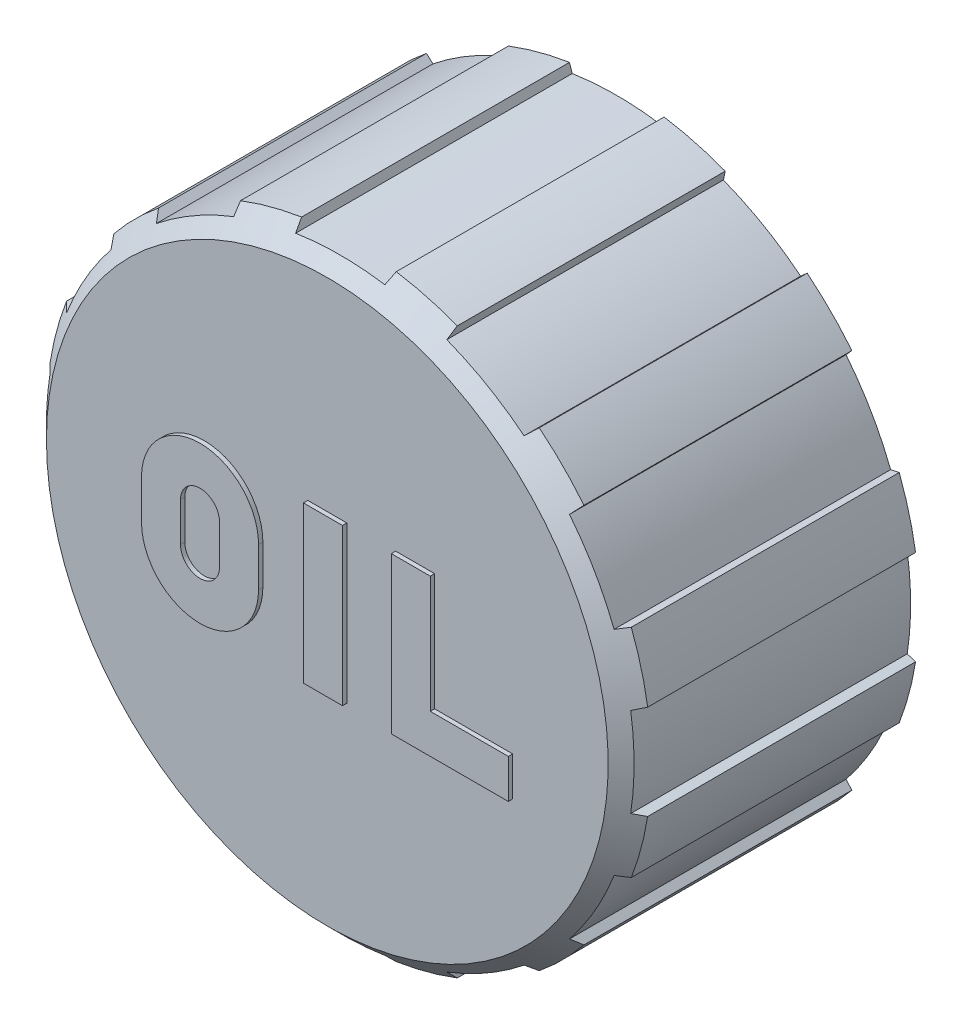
ISO-10303-21;
HEADER;
FILE_DESCRIPTION(('STEP AP214'),'2;1');
FILE_NAME('part.step','',(''),(''),'','','');
FILE_SCHEMA(('AUTOMOTIVE_DESIGN { 1 0 10303 214 1 1 1 1 }'));
ENDSEC;
DATA;
#1=APPLICATION_CONTEXT('core data for automotive mechanical design processes');
#2=APPLICATION_PROTOCOL_DEFINITION('international standard','automotive_design',2000,#1);
#3=PRODUCT_CONTEXT('',#1,'mechanical');
#4=PRODUCT('Part','Part','',(#3));
#5=PRODUCT_RELATED_PRODUCT_CATEGORY('part','',(#4));
#6=PRODUCT_DEFINITION_FORMATION('','',#4);
#7=PRODUCT_DEFINITION_CONTEXT('part definition',#1,'design');
#8=PRODUCT_DEFINITION('design','',#6,#7);
#9=PRODUCT_DEFINITION_SHAPE('','',#8);
#10=(LENGTH_UNIT() NAMED_UNIT(*) SI_UNIT(.MILLI.,.METRE.));
#11=(NAMED_UNIT(*) PLANE_ANGLE_UNIT() SI_UNIT($,.RADIAN.));
#12=(NAMED_UNIT(*) SI_UNIT($,.STERADIAN.) SOLID_ANGLE_UNIT());
#13=UNCERTAINTY_MEASURE_WITH_UNIT(LENGTH_MEASURE(1.E-05),#10,'distance_accuracy_value','');
#14=(GEOMETRIC_REPRESENTATION_CONTEXT(3) GLOBAL_UNCERTAINTY_ASSIGNED_CONTEXT((#13)) GLOBAL_UNIT_ASSIGNED_CONTEXT((#10,
#11,#12)) REPRESENTATION_CONTEXT('',''));
#15=CARTESIAN_POINT('',(0.,0.,0.));
#16=DIRECTION('',(0.,0.,1.));
#17=DIRECTION('',(1.,0.,0.));
#18=AXIS2_PLACEMENT_3D('',#15,#16,#17);
#19=CARTESIAN_POINT('',(-33.6058248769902,5.16222184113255,50.));
#20=DIRECTION('',(0.309016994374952,0.951056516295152,0.));
#21=DIRECTION('',(-0.951056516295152,0.309016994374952,0.));
#22=AXIS2_PLACEMENT_3D('',#19,#20,#21);
#23=PLANE('',#22);
#24=DIRECTION('',(-0.951056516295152,0.309016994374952,0.));
#25=VECTOR('',#24,1.);
#26=CARTESIAN_POINT('',(-33.6058248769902,5.16222184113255,16.));
#27=LINE('',#26,#25);
#28=CARTESIAN_POINT('',(-33.6058248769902,5.16222184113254,16.));
#29=VERTEX_POINT('',#28);
#30=CARTESIAN_POINT('',(-34.5690919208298,5.47520627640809,16.));
#31=VERTEX_POINT('',#30);
#32=EDGE_CURVE('E1193',#29,#31,#27,.T.);
#33=ORIENTED_EDGE('',*,*,#32,.F.);
#34=DIRECTION('',(0.,0.,1.));
#35=VECTOR('',#34,1.);
#36=CARTESIAN_POINT('',(-33.6058248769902,5.16222184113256,50.));
#37=LINE('',#36,#35);
#38=CARTESIAN_POINT('',(-33.6058248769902,5.16222184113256,48.));
#39=VERTEX_POINT('',#38);
#40=EDGE_CURVE('E648',#39,#29,#37,.F.);
#41=ORIENTED_EDGE('',*,*,#40,.F.);
#42=CARTESIAN_POINT('',(-34.5690919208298,5.47520627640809,47.));
#43=CARTESIAN_POINT('',(-34.4085770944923,5.42305184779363,47.1666982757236));
#44=CARTESIAN_POINT('',(-34.2480474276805,5.37089259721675,47.3333807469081));
#45=CARTESIAN_POINT('',(-33.9269584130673,5.26656445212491,47.6667140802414));
#46=CARTESIAN_POINT('',(-33.7663990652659,5.21439555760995,47.8333649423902));
#47=CARTESIAN_POINT('',(-33.6058248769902,5.16222184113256,48.));
#48=B_SPLINE_CURVE_WITH_KNOTS('',3,(#42,#43,#44,#45,#46,#47),.UNSPECIFIED.,.F.,.F.,(4,2,4),(0.,
0.711660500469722,1.42332100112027),.UNSPECIFIED.);
#49=CARTESIAN_POINT('',(-34.5690919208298,5.47520627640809,47.));
#50=VERTEX_POINT('',#49);
#51=EDGE_CURVE('E459',#50,#39,#48,.T.);
#52=ORIENTED_EDGE('',*,*,#51,.F.);
#53=DIRECTION('',(0.,0.,1.));
#54=VECTOR('',#53,1.);
#55=CARTESIAN_POINT('',(-34.5690919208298,5.47520627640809,50.));
#56=LINE('',#55,#54);
#57=EDGE_CURVE('E651',#31,#50,#56,.T.);
#58=ORIENTED_EDGE('',*,*,#57,.F.);
#59=EDGE_LOOP('',(#33,#41,#52,#58));
#60=FACE_BOUND('',#59,.T.);
#61=ADVANCED_FACE('F14',(#60),#23,.F.);
#62=CARTESIAN_POINT('',(6.11066752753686E-13,-1.04805053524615E-13,50.));
#63=DIRECTION('',(0.,0.,1.));
#64=DIRECTION('',(1.,0.,0.));
#65=AXIS2_PLACEMENT_3D('',#62,#63,#64);
#66=CYLINDRICAL_SURFACE('',#65,35.0000000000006);
#67=DIRECTION('',(0.,0.,1.));
#68=VECTOR('',#67,1.);
#69=CARTESIAN_POINT('',(-32.6753149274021,12.5428782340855,50.));
#70=LINE('',#69,#68);
#71=CARTESIAN_POINT('',(-32.6753149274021,12.5428782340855,47.));
#72=VERTEX_POINT('',#71);
#73=CARTESIAN_POINT('',(-32.6753149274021,12.5428782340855,16.));
#74=VERTEX_POINT('',#73);
#75=EDGE_CURVE('E656',#72,#74,#70,.F.);
#76=ORIENTED_EDGE('',*,*,#75,.T.);
#77=CARTESIAN_POINT('',(6.11066752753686E-13,-1.04805053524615E-13,16.));
#78=DIRECTION('',(0.,0.,-1.));
#79=DIRECTION('',(-1.,0.,0.));
#80=AXIS2_PLACEMENT_3D('',#77,#78,#79);
#81=CIRCLE('',#80,35.0000000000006);
#82=EDGE_CURVE('E1195',#74,#31,#81,.F.);
#83=ORIENTED_EDGE('',*,*,#82,.T.);
#84=ORIENTED_EDGE('',*,*,#57,.T.);
#85=CARTESIAN_POINT('',(0.,0.,47.));
#86=DIRECTION('',(0.,0.,-1.));
#87=DIRECTION('',(0.,1.,0.));
#88=AXIS2_PLACEMENT_3D('',#85,#86,#87);
#89=CIRCLE('',#88,35.);
#90=EDGE_CURVE('E655',#72,#50,#89,.F.);
#91=ORIENTED_EDGE('',*,*,#90,.F.);
#92=EDGE_LOOP('',(#76,#83,#84,#91));
#93=FACE_BOUND('',#92,.T.);
#94=ADVANCED_FACE('F1303',(#93),#66,.T.);
#95=CARTESIAN_POINT('',(-32.6753149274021,12.5428782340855,50.));
#96=DIRECTION('',(-0.207911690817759,-0.978147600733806,0.));
#97=DIRECTION('',(0.978147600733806,-0.207911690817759,0.));
#98=AXIS2_PLACEMENT_3D('',#95,#96,#97);
#99=PLANE('',#98);
#100=DIRECTION('',(0.978147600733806,-0.207911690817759,0.));
#101=VECTOR('',#100,1.);
#102=CARTESIAN_POINT('',(-32.6753149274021,12.5428782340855,16.));
#103=LINE('',#102,#101);
#104=CARTESIAN_POINT('',(-31.6846089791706,12.3322971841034,16.));
#105=VERTEX_POINT('',#104);
#106=EDGE_CURVE('E1198',#74,#105,#103,.T.);
#107=ORIENTED_EDGE('',*,*,#106,.F.);
#108=ORIENTED_EDGE('',*,*,#75,.F.);
#109=CARTESIAN_POINT('',(-31.6846089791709,12.3322971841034,48.));
#110=CARTESIAN_POINT('',(-31.8497571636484,12.367400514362,47.8333649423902));
#111=CARTESIAN_POINT('',(-32.0148900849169,12.4025006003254,47.6667140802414));
#112=CARTESIAN_POINT('',(-32.345125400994,12.4726942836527,47.3333807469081));
#113=CARTESIAN_POINT('',(-32.5102277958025,12.5077878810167,47.1666982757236));
#114=CARTESIAN_POINT('',(-32.6753149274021,12.5428782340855,47.));
#115=B_SPLINE_CURVE_WITH_KNOTS('',3,(#109,#110,#111,#112,#113,#114),.UNSPECIFIED.,.F.,.F.,(4,2,
4),(0.,0.711660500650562,1.42332100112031),.UNSPECIFIED.);
#116=CARTESIAN_POINT('',(-31.6846089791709,12.3322971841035,48.));
#117=VERTEX_POINT('',#116);
#118=EDGE_CURVE('E467',#117,#72,#115,.T.);
#119=ORIENTED_EDGE('',*,*,#118,.F.);
#120=DIRECTION('',(0.,0.,1.));
#121=VECTOR('',#120,1.);
#122=CARTESIAN_POINT('',(-31.6846089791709,12.3322971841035,50.));
#123=LINE('',#122,#121);
#124=EDGE_CURVE('E659',#105,#117,#123,.T.);
#125=ORIENTED_EDGE('',*,*,#124,.F.);
#126=EDGE_LOOP('',(#107,#108,#119,#125));
#127=FACE_BOUND('',#126,.T.);
#128=ADVANCED_FACE('F1308',(#127),#99,.F.);
#129=CARTESIAN_POINT('',(2.1316282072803E-13,-1.91846538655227E-13,50.));
#130=DIRECTION('',(0.,0.,1.));
#131=DIRECTION('',(1.,0.,0.));
#132=AXIS2_PLACEMENT_3D('',#129,#130,#131);
#133=CYLINDRICAL_SURFACE('',#132,34.);
#134=DIRECTION('',(0.,0.,1.));
#135=VECTOR('',#134,1.);
#136=CARTESIAN_POINT('',(-26.5223871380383,21.2735276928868,50.));
#137=LINE('',#136,#135);
#138=CARTESIAN_POINT('',(-26.5223871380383,21.2735276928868,48.));
#139=VERTEX_POINT('',#138);
#140=CARTESIAN_POINT('',(-26.5223871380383,21.2735276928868,16.));
#141=VERTEX_POINT('',#140);
#142=EDGE_CURVE('E664',#139,#141,#137,.F.);
#143=ORIENTED_EDGE('',*,*,#142,.T.);
#144=CARTESIAN_POINT('',(2.1316282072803E-13,-1.91846538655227E-13,16.));
#145=DIRECTION('',(0.,0.,-1.));
#146=DIRECTION('',(-1.,0.,0.));
#147=AXIS2_PLACEMENT_3D('',#144,#145,#146);
#148=CIRCLE('',#147,34.);
#149=EDGE_CURVE('E1200',#141,#105,#148,.F.);
#150=ORIENTED_EDGE('',*,*,#149,.T.);
#151=ORIENTED_EDGE('',*,*,#124,.T.);
#152=CARTESIAN_POINT('',(0.,0.,48.));
#153=DIRECTION('',(0.,0.,-1.));
#154=DIRECTION('',(0.,1.,0.));
#155=AXIS2_PLACEMENT_3D('',#152,#153,#154);
#156=CIRCLE('',#155,34.);
#157=EDGE_CURVE('E663',#139,#117,#156,.F.);
#158=ORIENTED_EDGE('',*,*,#157,.F.);
#159=EDGE_LOOP('',(#143,#150,#151,#158));
#160=FACE_BOUND('',#159,.T.);
#161=ADVANCED_FACE('F1317',(#160),#133,.T.);
#162=CARTESIAN_POINT('',(-26.5223871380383,21.2735276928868,50.));
#163=DIRECTION('',(0.743144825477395,0.669130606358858,0.));
#164=DIRECTION('',(-0.669130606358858,0.743144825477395,0.));
#165=AXIS2_PLACEMENT_3D('',#162,#163,#164);
#166=PLANE('',#165);
#167=DIRECTION('',(-0.669130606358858,0.743144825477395,0.));
#168=VECTOR('',#167,1.);
#169=CARTESIAN_POINT('',(-26.5223871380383,21.2735276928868,16.));
#170=LINE('',#169,#168);
#171=CARTESIAN_POINT('',(-27.2001086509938,22.0262136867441,16.));
#172=VERTEX_POINT('',#171);
#173=EDGE_CURVE('E1203',#141,#172,#170,.T.);
#174=ORIENTED_EDGE('',*,*,#173,.F.);
#175=ORIENTED_EDGE('',*,*,#142,.F.);
#176=CARTESIAN_POINT('',(-27.200108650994,22.0262136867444,47.));
#177=CARTESIAN_POINT('',(-27.0871759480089,21.9007892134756,47.1666982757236));
#178=CARTESIAN_POINT('',(-26.9742328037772,21.7753531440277,47.3333807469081));
#179=CARTESIAN_POINT('',(-26.748325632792,21.5244578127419,47.6667140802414));
#180=CARTESIAN_POINT('',(-26.6353616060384,21.3989985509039,47.8333649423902));
#181=CARTESIAN_POINT('',(-26.5223871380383,21.2735276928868,48.));
#182=B_SPLINE_CURVE_WITH_KNOTS('',3,(#176,#177,#178,#179,#180,#181),.UNSPECIFIED.,.F.,.F.,(4,2,
4),(0.,0.711660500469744,1.42332100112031),.UNSPECIFIED.);
#183=CARTESIAN_POINT('',(-27.200108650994,22.0262136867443,47.));
#184=VERTEX_POINT('',#183);
#185=EDGE_CURVE('E474',#184,#139,#182,.T.);
#186=ORIENTED_EDGE('',*,*,#185,.F.);
#187=DIRECTION('',(0.,0.,1.));
#188=VECTOR('',#187,1.);
#189=CARTESIAN_POINT('',(-27.200108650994,22.0262136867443,50.));
#190=LINE('',#189,#188);
#191=EDGE_CURVE('E667',#172,#184,#190,.T.);
#192=ORIENTED_EDGE('',*,*,#191,.F.);
#193=EDGE_LOOP('',(#174,#175,#186,#192));
#194=FACE_BOUND('',#193,.T.);
#195=ADVANCED_FACE('F492',(#194),#166,.F.);
#196=CARTESIAN_POINT('',(1.52766688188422E-13,-3.12638803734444E-13,50.));
#197=DIRECTION('',(0.,0.,1.));
#198=DIRECTION('',(1.,0.,0.));
#199=AXIS2_PLACEMENT_3D('',#196,#197,#198);
#200=CYLINDRICAL_SURFACE('',#199,35.);
#201=DIRECTION('',(0.,0.,1.));
#202=VECTOR('',#201,1.);
#203=CARTESIAN_POINT('',(-22.0262136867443,27.200108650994,50.));
#204=LINE('',#203,#202);
#205=CARTESIAN_POINT('',(-22.0262136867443,27.200108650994,47.));
#206=VERTEX_POINT('',#205);
#207=CARTESIAN_POINT('',(-22.0262136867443,27.200108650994,16.));
#208=VERTEX_POINT('',#207);
#209=EDGE_CURVE('E672',#206,#208,#204,.F.);
#210=ORIENTED_EDGE('',*,*,#209,.T.);
#211=CARTESIAN_POINT('',(1.52766688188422E-13,-3.12638803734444E-13,16.));
#212=DIRECTION('',(0.,0.,-1.));
#213=DIRECTION('',(-1.,0.,0.));
#214=AXIS2_PLACEMENT_3D('',#211,#212,#213);
#215=CIRCLE('',#214,35.);
#216=EDGE_CURVE('E985',#208,#172,#215,.F.);
#217=ORIENTED_EDGE('',*,*,#216,.T.);
#218=ORIENTED_EDGE('',*,*,#191,.T.);
#219=CARTESIAN_POINT('',(0.,0.,47.));
#220=DIRECTION('',(0.,0.,-1.));
#221=DIRECTION('',(0.,1.,0.));
#222=AXIS2_PLACEMENT_3D('',#219,#220,#221);
#223=CIRCLE('',#222,35.);
#224=EDGE_CURVE('E671',#206,#184,#223,.F.);
#225=ORIENTED_EDGE('',*,*,#224,.F.);
#226=EDGE_LOOP('',(#210,#217,#218,#225));
#227=FACE_BOUND('',#226,.T.);
#228=ADVANCED_FACE('F490',(#227),#200,.T.);
#229=CARTESIAN_POINT('',(-22.0262136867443,27.200108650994,50.));
#230=DIRECTION('',(-0.669130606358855,-0.743144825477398,0.));
#231=DIRECTION('',(0.743144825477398,-0.669130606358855,0.));
#232=AXIS2_PLACEMENT_3D('',#229,#230,#231);
#233=PLANE('',#232);
#234=DIRECTION('',(0.743144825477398,-0.669130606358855,0.));
#235=VECTOR('',#234,1.);
#236=CARTESIAN_POINT('',(-22.0262136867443,27.200108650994,16.));
#237=LINE('',#236,#235);
#238=CARTESIAN_POINT('',(-21.2735276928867,26.5223871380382,16.));
#239=VERTEX_POINT('',#238);
#240=EDGE_CURVE('E1206',#208,#239,#237,.T.);
#241=ORIENTED_EDGE('',*,*,#240,.F.);
#242=ORIENTED_EDGE('',*,*,#209,.F.);
#243=CARTESIAN_POINT('',(-21.2735276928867,26.5223871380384,48.));
#244=CARTESIAN_POINT('',(-21.3989985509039,26.6353616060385,47.8333649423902));
#245=CARTESIAN_POINT('',(-21.5244578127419,26.748325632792,47.6667140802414));
#246=CARTESIAN_POINT('',(-21.7753531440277,26.9742328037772,47.3333807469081));
#247=CARTESIAN_POINT('',(-21.9007892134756,27.0871759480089,47.1666982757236));
#248=CARTESIAN_POINT('',(-22.0262136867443,27.200108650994,47.));
#249=B_SPLINE_CURVE_WITH_KNOTS('',3,(#243,#244,#245,#246,#247,#248),.UNSPECIFIED.,.F.,.F.,(4,2,
4),(0.,0.71166050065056,1.42332100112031),.UNSPECIFIED.);
#250=CARTESIAN_POINT('',(-21.2735276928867,26.5223871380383,48.));
#251=VERTEX_POINT('',#250);
#252=EDGE_CURVE('E480',#251,#206,#249,.T.);
#253=ORIENTED_EDGE('',*,*,#252,.F.);
#254=DIRECTION('',(0.,0.,1.));
#255=VECTOR('',#254,1.);
#256=CARTESIAN_POINT('',(-21.2735276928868,26.5223871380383,50.));
#257=LINE('',#256,#255);
#258=EDGE_CURVE('E675',#239,#251,#257,.T.);
#259=ORIENTED_EDGE('',*,*,#258,.F.);
#260=EDGE_LOOP('',(#241,#242,#253,#259));
#261=FACE_BOUND('',#260,.T.);
#262=ADVANCED_FACE('F486',(#261),#233,.F.);
#263=CARTESIAN_POINT('',(0.,-1.4210854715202E-13,50.));
#264=DIRECTION('',(0.,0.,1.));
#265=DIRECTION('',(1.,0.,0.));
#266=AXIS2_PLACEMENT_3D('',#263,#264,#265);
#267=CYLINDRICAL_SURFACE('',#266,34.);
#268=DIRECTION('',(0.,0.,1.));
#269=VECTOR('',#268,1.);
#270=CARTESIAN_POINT('',(-12.3322971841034,31.6846089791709,50.));
#271=LINE('',#270,#269);
#272=CARTESIAN_POINT('',(-12.3322971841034,31.6846089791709,48.));
#273=VERTEX_POINT('',#272);
#274=CARTESIAN_POINT('',(-12.3322971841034,31.6846089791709,16.));
#275=VERTEX_POINT('',#274);
#276=EDGE_CURVE('E680',#273,#275,#271,.F.);
#277=ORIENTED_EDGE('',*,*,#276,.T.);
#278=CARTESIAN_POINT('',(0.,-1.4210854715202E-13,16.));
#279=DIRECTION('',(0.,0.,-1.));
#280=DIRECTION('',(-1.,0.,0.));
#281=AXIS2_PLACEMENT_3D('',#278,#279,#280);
#282=CIRCLE('',#281,34.);
#283=EDGE_CURVE('E973',#275,#239,#282,.F.);
#284=ORIENTED_EDGE('',*,*,#283,.T.);
#285=ORIENTED_EDGE('',*,*,#258,.T.);
#286=CARTESIAN_POINT('',(0.,0.,48.));
#287=DIRECTION('',(0.,0.,-1.));
#288=DIRECTION('',(0.,1.,0.));
#289=AXIS2_PLACEMENT_3D('',#286,#287,#288);
#290=CIRCLE('',#289,34.);
#291=EDGE_CURVE('E679',#273,#251,#290,.F.);
#292=ORIENTED_EDGE('',*,*,#291,.F.);
#293=EDGE_LOOP('',(#277,#284,#285,#292));
#294=FACE_BOUND('',#293,.T.);
#295=ADVANCED_FACE('F489',(#294),#267,.T.);
#296=CARTESIAN_POINT('',(-12.3322971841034,31.6846089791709,50.));
#297=DIRECTION('',(0.978147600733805,0.207911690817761,0.));
#298=DIRECTION('',(-0.207911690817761,0.978147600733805,0.));
#299=AXIS2_PLACEMENT_3D('',#296,#297,#298);
#300=PLANE('',#299);
#301=DIRECTION('',(-0.207911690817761,0.978147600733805,0.));
#302=VECTOR('',#301,1.);
#303=CARTESIAN_POINT('',(-12.3322971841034,31.6846089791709,16.));
#304=LINE('',#303,#302);
#305=CARTESIAN_POINT('',(-12.5428782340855,32.6753149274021,16.));
#306=VERTEX_POINT('',#305);
#307=EDGE_CURVE('E966',#275,#306,#304,.T.);
#308=ORIENTED_EDGE('',*,*,#307,.F.);
#309=ORIENTED_EDGE('',*,*,#276,.F.);
#310=CARTESIAN_POINT('',(-12.5428782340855,32.6753149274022,47.));
#311=CARTESIAN_POINT('',(-12.5077878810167,32.5102277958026,47.1666982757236));
#312=CARTESIAN_POINT('',(-12.4726942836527,32.345125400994,47.3333807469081));
#313=CARTESIAN_POINT('',(-12.4025006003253,32.0148900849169,47.6667140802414));
#314=CARTESIAN_POINT('',(-12.367400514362,31.8497571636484,47.8333649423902));
#315=CARTESIAN_POINT('',(-12.3322971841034,31.6846089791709,48.));
#316=B_SPLINE_CURVE_WITH_KNOTS('',3,(#310,#311,#312,#313,#314,#315),.UNSPECIFIED.,.F.,.F.,(4,2,
4),(0.,0.711660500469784,1.42332100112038),.UNSPECIFIED.);
#317=CARTESIAN_POINT('',(-12.5428782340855,32.6753149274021,47.));
#318=VERTEX_POINT('',#317);
#319=EDGE_CURVE('E321',#318,#273,#316,.T.);
#320=ORIENTED_EDGE('',*,*,#319,.F.);
#321=DIRECTION('',(0.,0.,1.));
#322=VECTOR('',#321,1.);
#323=CARTESIAN_POINT('',(-12.5428782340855,32.6753149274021,50.));
#324=LINE('',#323,#322);
#325=EDGE_CURVE('E683',#306,#318,#324,.T.);
#326=ORIENTED_EDGE('',*,*,#325,.F.);
#327=EDGE_LOOP('',(#308,#309,#320,#326));
#328=FACE_BOUND('',#327,.T.);
#329=ADVANCED_FACE('F494',(#328),#300,.F.);
#330=CARTESIAN_POINT('',(1.58095758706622E-13,-1.62003743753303E-12,50.));
#331=DIRECTION('',(0.,0.,1.));
#332=DIRECTION('',(1.,0.,0.));
#333=AXIS2_PLACEMENT_3D('',#330,#331,#332);
#334=CYLINDRICAL_SURFACE('',#333,35.0000000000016);
#335=DIRECTION('',(0.,0.,1.));
#336=VECTOR('',#335,1.);
#337=CARTESIAN_POINT('',(-5.47520627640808,34.5690919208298,50.));
#338=LINE('',#337,#336);
#339=CARTESIAN_POINT('',(-5.47520627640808,34.5690919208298,47.));
#340=VERTEX_POINT('',#339);
#341=CARTESIAN_POINT('',(-5.47520627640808,34.5690919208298,16.));
#342=VERTEX_POINT('',#341);
#343=EDGE_CURVE('E688',#340,#342,#338,.F.);
#344=ORIENTED_EDGE('',*,*,#343,.T.);
#345=CARTESIAN_POINT('',(1.58095758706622E-13,-1.62003743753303E-12,16.));
#346=DIRECTION('',(0.,0.,-1.));
#347=DIRECTION('',(-1.,0.,0.));
#348=AXIS2_PLACEMENT_3D('',#345,#346,#347);
#349=CIRCLE('',#348,35.0000000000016);
#350=EDGE_CURVE('E1210',#342,#306,#349,.F.);
#351=ORIENTED_EDGE('',*,*,#350,.T.);
#352=ORIENTED_EDGE('',*,*,#325,.T.);
#353=CARTESIAN_POINT('',(0.,0.,47.));
#354=DIRECTION('',(0.,0.,-1.));
#355=DIRECTION('',(0.,1.,0.));
#356=AXIS2_PLACEMENT_3D('',#353,#354,#355);
#357=CIRCLE('',#356,35.);
#358=EDGE_CURVE('E687',#340,#318,#357,.F.);
#359=ORIENTED_EDGE('',*,*,#358,.F.);
#360=EDGE_LOOP('',(#344,#351,#352,#359));
#361=FACE_BOUND('',#360,.T.);
#362=ADVANCED_FACE('F498',(#361),#334,.T.);
#363=CARTESIAN_POINT('',(-5.47520627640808,34.5690919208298,50.));
#364=DIRECTION('',(-0.951056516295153,-0.309016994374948,0.));
#365=DIRECTION('',(0.309016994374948,-0.951056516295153,0.));
#366=AXIS2_PLACEMENT_3D('',#363,#364,#365);
#367=PLANE('',#366);
#368=DIRECTION('',(0.309016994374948,-0.951056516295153,0.));
#369=VECTOR('',#368,1.);
#370=CARTESIAN_POINT('',(-5.47520627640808,34.5690919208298,16.));
#371=LINE('',#370,#369);
#372=CARTESIAN_POINT('',(-5.16222184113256,33.6058248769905,16.));
#373=VERTEX_POINT('',#372);
#374=EDGE_CURVE('E956',#342,#373,#371,.T.);
#375=ORIENTED_EDGE('',*,*,#374,.F.);
#376=ORIENTED_EDGE('',*,*,#343,.F.);
#377=CARTESIAN_POINT('',(-5.16222184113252,33.6058248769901,48.));
#378=CARTESIAN_POINT('',(-5.21439555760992,33.7663990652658,47.8333649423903));
#379=CARTESIAN_POINT('',(-5.26656445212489,33.9269584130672,47.6667140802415));
#380=CARTESIAN_POINT('',(-5.37089259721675,34.2480474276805,47.3333807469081));
#381=CARTESIAN_POINT('',(-5.42305184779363,34.4085770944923,47.1666982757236));
#382=CARTESIAN_POINT('',(-5.47520627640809,34.5690919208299,47.));
#383=B_SPLINE_CURVE_WITH_KNOTS('',3,(#377,#378,#379,#380,#381,#382),.UNSPECIFIED.,.F.,.F.,(4,2,
4),(0.,0.711660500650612,1.42332100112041),.UNSPECIFIED.);
#384=CARTESIAN_POINT('',(-5.16222184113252,33.6058248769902,48.));
#385=VERTEX_POINT('',#384);
#386=EDGE_CURVE('E507',#385,#340,#383,.T.);
#387=ORIENTED_EDGE('',*,*,#386,.F.);
#388=DIRECTION('',(0.,0.,1.));
#389=VECTOR('',#388,1.);
#390=CARTESIAN_POINT('',(-5.16222184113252,33.6058248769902,50.));
#391=LINE('',#390,#389);
#392=EDGE_CURVE('E691',#373,#385,#391,.T.);
#393=ORIENTED_EDGE('',*,*,#392,.F.);
#394=EDGE_LOOP('',(#375,#376,#387,#393));
#395=FACE_BOUND('',#394,.T.);
#396=ADVANCED_FACE('F500',(#395),#367,.F.);
#397=CARTESIAN_POINT('',(1.54543045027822E-13,2.34479102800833E-13,50.));
#398=DIRECTION('',(0.,0.,1.));
#399=DIRECTION('',(1.,0.,0.));
#400=AXIS2_PLACEMENT_3D('',#397,#398,#399);
#401=CYLINDRICAL_SURFACE('',#400,34.);
#402=DIRECTION('',(0.,0.,1.));
#403=VECTOR('',#402,1.);
#404=CARTESIAN_POINT('',(5.16222184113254,33.6058248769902,50.));
#405=LINE('',#404,#403);
#406=CARTESIAN_POINT('',(5.16222184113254,33.6058248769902,48.));
#407=VERTEX_POINT('',#406);
#408=CARTESIAN_POINT('',(5.16222184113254,33.6058248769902,16.));
#409=VERTEX_POINT('',#408);
#410=EDGE_CURVE('E696',#407,#409,#405,.F.);
#411=ORIENTED_EDGE('',*,*,#410,.T.);
#412=CARTESIAN_POINT('',(1.54543045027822E-13,2.34479102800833E-13,16.));
#413=DIRECTION('',(0.,0.,-1.));
#414=DIRECTION('',(-1.,0.,0.));
#415=AXIS2_PLACEMENT_3D('',#412,#413,#414);
#416=CIRCLE('',#415,34.);
#417=EDGE_CURVE('E951',#409,#373,#416,.F.);
#418=ORIENTED_EDGE('',*,*,#417,.T.);
#419=ORIENTED_EDGE('',*,*,#392,.T.);
#420=CARTESIAN_POINT('',(0.,0.,48.));
#421=DIRECTION('',(0.,0.,-1.));
#422=DIRECTION('',(0.,1.,0.));
#423=AXIS2_PLACEMENT_3D('',#420,#421,#422);
#424=CIRCLE('',#423,34.);
#425=EDGE_CURVE('E694',#407,#385,#424,.F.);
#426=ORIENTED_EDGE('',*,*,#425,.F.);
#427=EDGE_LOOP('',(#411,#418,#419,#426));
#428=FACE_BOUND('',#427,.T.);
#429=ADVANCED_FACE('F503',(#428),#401,.T.);
#430=CARTESIAN_POINT('',(5.16222184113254,33.6058248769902,50.));
#431=DIRECTION('',(0.951056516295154,-0.309016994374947,0.));
#432=DIRECTION('',(0.309016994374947,0.951056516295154,0.));
#433=AXIS2_PLACEMENT_3D('',#430,#431,#432);
#434=PLANE('',#433);
#435=DIRECTION('',(0.309016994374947,0.951056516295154,0.));
#436=VECTOR('',#435,1.);
#437=CARTESIAN_POINT('',(5.16222184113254,33.6058248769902,16.));
#438=LINE('',#437,#436);
#439=CARTESIAN_POINT('',(5.47520627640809,34.5690919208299,16.));
#440=VERTEX_POINT('',#439);
#441=EDGE_CURVE('E860',#409,#440,#438,.T.);
#442=ORIENTED_EDGE('',*,*,#441,.F.);
#443=ORIENTED_EDGE('',*,*,#410,.F.);
#444=CARTESIAN_POINT('',(5.47520627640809,34.5690919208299,47.));
#445=CARTESIAN_POINT('',(5.42305184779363,34.4085770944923,47.1666982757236));
#446=CARTESIAN_POINT('',(5.37089259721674,34.2480474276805,47.3333807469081));
#447=CARTESIAN_POINT('',(5.2665644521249,33.9269584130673,47.6667140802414));
#448=CARTESIAN_POINT('',(5.21439555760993,33.7663990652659,47.8333649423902));
#449=CARTESIAN_POINT('',(5.16222184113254,33.6058248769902,48.));
#450=B_SPLINE_CURVE_WITH_KNOTS('',3,(#444,#445,#446,#447,#448,#449),.UNSPECIFIED.,.F.,.F.,(4,2,
4),(0.,0.711660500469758,1.42332100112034),.UNSPECIFIED.);
#451=CARTESIAN_POINT('',(5.47520627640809,34.5690919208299,47.));
#452=VERTEX_POINT('',#451);
#453=EDGE_CURVE('E333',#452,#407,#450,.T.);
#454=ORIENTED_EDGE('',*,*,#453,.F.);
#455=DIRECTION('',(0.,0.,1.));
#456=VECTOR('',#455,1.);
#457=CARTESIAN_POINT('',(5.47520627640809,34.5690919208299,50.));
#458=LINE('',#457,#456);
#459=EDGE_CURVE('E700',#440,#452,#458,.T.);
#460=ORIENTED_EDGE('',*,*,#459,.F.);
#461=EDGE_LOOP('',(#442,#443,#454,#460));
#462=FACE_BOUND('',#461,.T.);
#463=ADVANCED_FACE('F505',(#462),#434,.F.);
#464=CARTESIAN_POINT('',(-5.04485342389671E-13,-1.04449782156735E-12,50.));
#465=DIRECTION('',(0.,0.,1.));
#466=DIRECTION('',(1.,0.,0.));
#467=AXIS2_PLACEMENT_3D('',#464,#465,#466);
#468=CYLINDRICAL_SURFACE('',#467,35.0000000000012);
#469=DIRECTION('',(0.,0.,1.));
#470=VECTOR('',#469,1.);
#471=CARTESIAN_POINT('',(12.5428782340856,32.6753149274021,50.));
#472=LINE('',#471,#470);
#473=CARTESIAN_POINT('',(12.5428782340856,32.6753149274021,47.));
#474=VERTEX_POINT('',#473);
#475=CARTESIAN_POINT('',(12.5428782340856,32.6753149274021,16.));
#476=VERTEX_POINT('',#475);
#477=EDGE_CURVE('E697',#474,#476,#472,.F.);
#478=ORIENTED_EDGE('',*,*,#477,.T.);
#479=CARTESIAN_POINT('',(-5.04485342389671E-13,-1.04449782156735E-12,16.));
#480=DIRECTION('',(0.,0.,-1.));
#481=DIRECTION('',(-1.,0.,0.));
#482=AXIS2_PLACEMENT_3D('',#479,#480,#481);
#483=CIRCLE('',#482,35.0000000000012);
#484=EDGE_CURVE('E854',#476,#440,#483,.F.);
#485=ORIENTED_EDGE('',*,*,#484,.T.);
#486=ORIENTED_EDGE('',*,*,#459,.T.);
#487=CARTESIAN_POINT('',(0.,0.,47.));
#488=DIRECTION('',(0.,0.,-1.));
#489=DIRECTION('',(0.,1.,0.));
#490=AXIS2_PLACEMENT_3D('',#487,#488,#489);
#491=CIRCLE('',#490,35.);
#492=EDGE_CURVE('E703',#474,#452,#491,.F.);
#493=ORIENTED_EDGE('',*,*,#492,.F.);
#494=EDGE_LOOP('',(#478,#485,#486,#493));
#495=FACE_BOUND('',#494,.T.);
#496=ADVANCED_FACE('F850',(#495),#468,.T.);
#497=CARTESIAN_POINT('',(12.5428782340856,32.675314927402,50.));
#498=DIRECTION('',(-0.978147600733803,0.207911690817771,0.));
#499=DIRECTION('',(-0.207911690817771,-0.978147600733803,0.));
#500=AXIS2_PLACEMENT_3D('',#497,#498,#499);
#501=PLANE('',#500);
#502=DIRECTION('',(-0.207911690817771,-0.978147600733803,0.));
#503=VECTOR('',#502,1.);
#504=CARTESIAN_POINT('',(12.5428782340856,32.675314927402,16.));
#505=LINE('',#504,#503);
#506=CARTESIAN_POINT('',(12.3322971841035,31.6846089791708,16.));
#507=VERTEX_POINT('',#506);
#508=EDGE_CURVE('E847',#476,#507,#505,.T.);
#509=ORIENTED_EDGE('',*,*,#508,.F.);
#510=ORIENTED_EDGE('',*,*,#477,.F.);
#511=CARTESIAN_POINT('',(12.3322971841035,31.6846089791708,48.));
#512=CARTESIAN_POINT('',(12.3674005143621,31.8497571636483,47.8333649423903));
#513=CARTESIAN_POINT('',(12.4025006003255,32.0148900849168,47.6667140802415));
#514=CARTESIAN_POINT('',(12.4726942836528,32.3451254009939,47.3333807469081));
#515=CARTESIAN_POINT('',(12.5077878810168,32.5102277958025,47.1666982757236));
#516=CARTESIAN_POINT('',(12.5428782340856,32.6753149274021,47.));
#517=B_SPLINE_CURVE_WITH_KNOTS('',3,(#511,#512,#513,#514,#515,#516),.UNSPECIFIED.,.F.,.F.,(4,2,
4),(0.,0.711660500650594,1.42332100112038),.UNSPECIFIED.);
#518=CARTESIAN_POINT('',(12.3322971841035,31.6846089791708,48.));
#519=VERTEX_POINT('',#518);
#520=EDGE_CURVE('E341',#519,#474,#517,.T.);
#521=ORIENTED_EDGE('',*,*,#520,.F.);
#522=DIRECTION('',(0.,0.,1.));
#523=VECTOR('',#522,1.);
#524=CARTESIAN_POINT('',(12.3322971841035,31.6846089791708,50.));
#525=LINE('',#524,#523);
#526=EDGE_CURVE('E701',#507,#519,#525,.T.);
#527=ORIENTED_EDGE('',*,*,#526,.F.);
#528=EDGE_LOOP('',(#509,#510,#521,#527));
#529=FACE_BOUND('',#528,.T.);
#530=ADVANCED_FACE('F843',(#529),#501,.F.);
#531=CARTESIAN_POINT('',(4.72510919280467E-13,4.72510919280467E-13,50.));
#532=DIRECTION('',(0.,0.,1.));
#533=DIRECTION('',(1.,0.,0.));
#534=AXIS2_PLACEMENT_3D('',#531,#532,#533);
#535=CYLINDRICAL_SURFACE('',#534,33.9999999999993);
#536=DIRECTION('',(0.,0.,1.));
#537=VECTOR('',#536,1.);
#538=CARTESIAN_POINT('',(21.2735276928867,26.5223871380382,50.));
#539=LINE('',#538,#537);
#540=CARTESIAN_POINT('',(21.2735276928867,26.5223871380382,48.));
#541=VERTEX_POINT('',#540);
#542=CARTESIAN_POINT('',(21.2735276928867,26.5223871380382,16.));
#543=VERTEX_POINT('',#542);
#544=EDGE_CURVE('E706',#541,#543,#539,.F.);
#545=ORIENTED_EDGE('',*,*,#544,.T.);
#546=CARTESIAN_POINT('',(4.72510919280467E-13,4.72510919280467E-13,16.));
#547=DIRECTION('',(0.,0.,-1.));
#548=DIRECTION('',(-1.,0.,0.));
#549=AXIS2_PLACEMENT_3D('',#546,#547,#548);
#550=CIRCLE('',#549,33.9999999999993);
#551=EDGE_CURVE('E840',#543,#507,#550,.F.);
#552=ORIENTED_EDGE('',*,*,#551,.T.);
#553=ORIENTED_EDGE('',*,*,#526,.T.);
#554=CARTESIAN_POINT('',(0.,0.,48.));
#555=DIRECTION('',(0.,0.,-1.));
#556=DIRECTION('',(0.,1.,0.));
#557=AXIS2_PLACEMENT_3D('',#554,#555,#556);
#558=CIRCLE('',#557,34.);
#559=EDGE_CURVE('E705',#541,#519,#558,.F.);
#560=ORIENTED_EDGE('',*,*,#559,.F.);
#561=EDGE_LOOP('',(#545,#552,#553,#560));
#562=FACE_BOUND('',#561,.T.);
#563=ADVANCED_FACE('F836',(#562),#535,.T.);
#564=CARTESIAN_POINT('',(21.2735276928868,26.5223871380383,50.));
#565=DIRECTION('',(0.669130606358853,-0.743144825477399,0.));
#566=DIRECTION('',(0.743144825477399,0.669130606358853,0.));
#567=AXIS2_PLACEMENT_3D('',#564,#565,#566);
#568=PLANE('',#567);
#569=DIRECTION('',(0.743144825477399,0.669130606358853,0.));
#570=VECTOR('',#569,1.);
#571=CARTESIAN_POINT('',(21.2735276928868,26.5223871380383,16.));
#572=LINE('',#571,#570);
#573=CARTESIAN_POINT('',(22.0262136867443,27.200108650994,16.));
#574=VERTEX_POINT('',#573);
#575=EDGE_CURVE('E833',#543,#574,#572,.T.);
#576=ORIENTED_EDGE('',*,*,#575,.F.);
#577=ORIENTED_EDGE('',*,*,#544,.F.);
#578=CARTESIAN_POINT('',(22.0262136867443,27.200108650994,47.));
#579=CARTESIAN_POINT('',(21.9007892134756,27.0871759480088,47.1666982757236));
#580=CARTESIAN_POINT('',(21.7753531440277,26.9742328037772,47.3333807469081));
#581=CARTESIAN_POINT('',(21.5244578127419,26.748325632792,47.6667140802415));
#582=CARTESIAN_POINT('',(21.3989985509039,26.6353616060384,47.8333649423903));
#583=CARTESIAN_POINT('',(21.2735276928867,26.5223871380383,48.));
#584=B_SPLINE_CURVE_WITH_KNOTS('',3,(#578,#579,#580,#581,#582,#583),.UNSPECIFIED.,.F.,.F.,(4,2,
4),(0.,0.711660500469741,1.4233210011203),.UNSPECIFIED.);
#585=CARTESIAN_POINT('',(22.0262136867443,27.200108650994,47.));
#586=VERTEX_POINT('',#585);
#587=EDGE_CURVE('E349',#586,#541,#584,.T.);
#588=ORIENTED_EDGE('',*,*,#587,.F.);
#589=DIRECTION('',(0.,0.,1.));
#590=VECTOR('',#589,1.);
#591=CARTESIAN_POINT('',(22.0262136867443,27.2001086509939,50.));
#592=LINE('',#591,#590);
#593=EDGE_CURVE('E709',#574,#586,#592,.T.);
#594=ORIENTED_EDGE('',*,*,#593,.F.);
#595=EDGE_LOOP('',(#576,#577,#588,#594));
#596=FACE_BOUND('',#595,.T.);
#597=ADVANCED_FACE('F829',(#596),#568,.F.);
#598=CARTESIAN_POINT('',(6.60804744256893E-13,5.61328761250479E-13,50.));
#599=DIRECTION('',(0.,0.,1.));
#600=DIRECTION('',(1.,0.,0.));
#601=AXIS2_PLACEMENT_3D('',#598,#599,#600);
#602=CYLINDRICAL_SURFACE('',#601,34.9999999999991);
#603=DIRECTION('',(0.,0.,1.));
#604=VECTOR('',#603,1.);
#605=CARTESIAN_POINT('',(27.200108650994,22.0262136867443,50.));
#606=LINE('',#605,#604);
#607=CARTESIAN_POINT('',(27.200108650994,22.0262136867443,47.));
#608=VERTEX_POINT('',#607);
#609=CARTESIAN_POINT('',(27.200108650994,22.0262136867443,16.));
#610=VERTEX_POINT('',#609);
#611=EDGE_CURVE('E713',#608,#610,#606,.F.);
#612=ORIENTED_EDGE('',*,*,#611,.T.);
#613=CARTESIAN_POINT('',(6.60804744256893E-13,5.61328761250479E-13,16.));
#614=DIRECTION('',(0.,0.,-1.));
#615=DIRECTION('',(-1.,0.,0.));
#616=AXIS2_PLACEMENT_3D('',#613,#614,#615);
#617=CIRCLE('',#616,34.9999999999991);
#618=EDGE_CURVE('E826',#610,#574,#617,.F.);
#619=ORIENTED_EDGE('',*,*,#618,.T.);
#620=ORIENTED_EDGE('',*,*,#593,.T.);
#621=CARTESIAN_POINT('',(0.,0.,47.));
#622=DIRECTION('',(0.,0.,-1.));
#623=DIRECTION('',(0.,1.,0.));
#624=AXIS2_PLACEMENT_3D('',#621,#622,#623);
#625=CIRCLE('',#624,35.);
#626=EDGE_CURVE('E712',#608,#586,#625,.F.);
#627=ORIENTED_EDGE('',*,*,#626,.F.);
#628=EDGE_LOOP('',(#612,#619,#620,#627));
#629=FACE_BOUND('',#628,.T.);
#630=ADVANCED_FACE('F822',(#629),#602,.T.);
#631=CARTESIAN_POINT('',(27.200108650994,22.0262136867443,50.));
#632=DIRECTION('',(-0.743144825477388,0.669130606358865,0.));
#633=DIRECTION('',(-0.669130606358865,-0.743144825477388,0.));
#634=AXIS2_PLACEMENT_3D('',#631,#632,#633);
#635=PLANE('',#634);
#636=DIRECTION('',(-0.669130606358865,-0.743144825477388,0.));
#637=VECTOR('',#636,1.);
#638=CARTESIAN_POINT('',(27.200108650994,22.0262136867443,16.));
#639=LINE('',#638,#637);
#640=CARTESIAN_POINT('',(26.5223871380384,21.2735276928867,16.));
#641=VERTEX_POINT('',#640);
#642=EDGE_CURVE('E819',#610,#641,#639,.T.);
#643=ORIENTED_EDGE('',*,*,#642,.F.);
#644=ORIENTED_EDGE('',*,*,#611,.F.);
#645=CARTESIAN_POINT('',(26.5223871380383,21.2735276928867,48.));
#646=CARTESIAN_POINT('',(26.6353616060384,21.3989985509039,47.8333649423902));
#647=CARTESIAN_POINT('',(26.748325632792,21.5244578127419,47.6667140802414));
#648=CARTESIAN_POINT('',(26.9742328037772,21.7753531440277,47.3333807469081));
#649=CARTESIAN_POINT('',(27.0871759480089,21.9007892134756,47.1666982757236));
#650=CARTESIAN_POINT('',(27.200108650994,22.0262136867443,47.));
#651=B_SPLINE_CURVE_WITH_KNOTS('',3,(#645,#646,#647,#648,#649,#650),.UNSPECIFIED.,.F.,.F.,(4,2,
4),(0.,0.711660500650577,1.42332100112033),.UNSPECIFIED.);
#652=CARTESIAN_POINT('',(26.5223871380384,21.2735276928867,48.));
#653=VERTEX_POINT('',#652);
#654=EDGE_CURVE('E357',#653,#608,#651,.T.);
#655=ORIENTED_EDGE('',*,*,#654,.F.);
#656=DIRECTION('',(0.,0.,1.));
#657=VECTOR('',#656,1.);
#658=CARTESIAN_POINT('',(26.5223871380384,21.2735276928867,50.));
#659=LINE('',#658,#657);
#660=EDGE_CURVE('E716',#641,#653,#659,.T.);
#661=ORIENTED_EDGE('',*,*,#660,.F.);
#662=EDGE_LOOP('',(#643,#644,#655,#661));
#663=FACE_BOUND('',#662,.T.);
#664=ADVANCED_FACE('F815',(#663),#635,.F.);
#665=CARTESIAN_POINT('',(0.,0.,50.));
#666=DIRECTION('',(0.,0.,1.));
#667=DIRECTION('',(1.,0.,0.));
#668=AXIS2_PLACEMENT_3D('',#665,#666,#667);
#669=CYLINDRICAL_SURFACE('',#668,34.);
#670=DIRECTION('',(0.,0.,1.));
#671=VECTOR('',#670,1.);
#672=CARTESIAN_POINT('',(31.6846089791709,12.3322971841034,50.));
#673=LINE('',#672,#671);
#674=CARTESIAN_POINT('',(31.6846089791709,12.3322971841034,48.));
#675=VERTEX_POINT('',#674);
#676=CARTESIAN_POINT('',(31.6846089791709,12.3322971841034,16.));
#677=VERTEX_POINT('',#676);
#678=EDGE_CURVE('E720',#675,#677,#673,.F.);
#679=ORIENTED_EDGE('',*,*,#678,.T.);
#680=CARTESIAN_POINT('',(0.,0.,16.));
#681=DIRECTION('',(0.,0.,-1.));
#682=DIRECTION('',(-1.,0.,0.));
#683=AXIS2_PLACEMENT_3D('',#680,#681,#682);
#684=CIRCLE('',#683,34.);
#685=EDGE_CURVE('E812',#677,#641,#684,.F.);
#686=ORIENTED_EDGE('',*,*,#685,.T.);
#687=ORIENTED_EDGE('',*,*,#660,.T.);
#688=CARTESIAN_POINT('',(0.,0.,48.));
#689=DIRECTION('',(0.,0.,-1.));
#690=DIRECTION('',(0.,1.,0.));
#691=AXIS2_PLACEMENT_3D('',#688,#689,#690);
#692=CIRCLE('',#691,34.);
#693=EDGE_CURVE('E719',#675,#653,#692,.F.);
#694=ORIENTED_EDGE('',*,*,#693,.F.);
#695=EDGE_LOOP('',(#679,#686,#687,#694));
#696=FACE_BOUND('',#695,.T.);
#697=ADVANCED_FACE('F808',(#696),#669,.T.);
#698=CARTESIAN_POINT('',(31.6846089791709,12.3322971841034,50.));
#699=DIRECTION('',(0.207911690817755,-0.978147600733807,0.));
#700=DIRECTION('',(0.978147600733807,0.207911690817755,0.));
#701=AXIS2_PLACEMENT_3D('',#698,#699,#700);
#702=PLANE('',#701);
#703=DIRECTION('',(0.978147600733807,0.207911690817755,0.));
#704=VECTOR('',#703,1.);
#705=CARTESIAN_POINT('',(31.6846089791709,12.3322971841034,16.));
#706=LINE('',#705,#704);
#707=CARTESIAN_POINT('',(32.675314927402,12.5428782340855,16.));
#708=VERTEX_POINT('',#707);
#709=EDGE_CURVE('E805',#677,#708,#706,.T.);
#710=ORIENTED_EDGE('',*,*,#709,.F.);
#711=ORIENTED_EDGE('',*,*,#678,.F.);
#712=CARTESIAN_POINT('',(32.675314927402,12.5428782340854,47.));
#713=CARTESIAN_POINT('',(32.5102277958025,12.5077878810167,47.1666982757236));
#714=CARTESIAN_POINT('',(32.3451254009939,12.4726942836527,47.3333807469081));
#715=CARTESIAN_POINT('',(32.0148900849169,12.4025006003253,47.6667140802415));
#716=CARTESIAN_POINT('',(31.8497571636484,12.367400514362,47.8333649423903));
#717=CARTESIAN_POINT('',(31.6846089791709,12.3322971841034,48.));
#718=B_SPLINE_CURVE_WITH_KNOTS('',3,(#712,#713,#714,#715,#716,#717),.UNSPECIFIED.,.F.,.F.,(4,2,
4),(0.,0.711660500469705,1.42332100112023),.UNSPECIFIED.);
#719=CARTESIAN_POINT('',(32.675314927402,12.5428782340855,47.));
#720=VERTEX_POINT('',#719);
#721=EDGE_CURVE('E365',#720,#675,#718,.T.);
#722=ORIENTED_EDGE('',*,*,#721,.F.);
#723=DIRECTION('',(0.,0.,1.));
#724=VECTOR('',#723,1.);
#725=CARTESIAN_POINT('',(32.675314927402,12.5428782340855,50.));
#726=LINE('',#725,#724);
#727=EDGE_CURVE('E723',#708,#720,#726,.T.);
#728=ORIENTED_EDGE('',*,*,#727,.F.);
#729=EDGE_LOOP('',(#710,#711,#722,#728));
#730=FACE_BOUND('',#729,.T.);
#731=ADVANCED_FACE('F801',(#730),#702,.F.);
#732=CARTESIAN_POINT('',(1.442401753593E-12,2.17603712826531E-13,50.));
#733=DIRECTION('',(0.,0.,1.));
#734=DIRECTION('',(1.,0.,0.));
#735=AXIS2_PLACEMENT_3D('',#732,#733,#734);
#736=CYLINDRICAL_SURFACE('',#735,34.9999999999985);
#737=DIRECTION('',(0.,0.,1.));
#738=VECTOR('',#737,1.);
#739=CARTESIAN_POINT('',(34.5690919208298,5.47520627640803,50.));
#740=LINE('',#739,#738);
#741=CARTESIAN_POINT('',(34.5690919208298,5.47520627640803,47.));
#742=VERTEX_POINT('',#741);
#743=CARTESIAN_POINT('',(34.5690919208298,5.47520627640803,16.));
#744=VERTEX_POINT('',#743);
#745=EDGE_CURVE('E727',#742,#744,#740,.F.);
#746=ORIENTED_EDGE('',*,*,#745,.T.);
#747=CARTESIAN_POINT('',(1.442401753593E-12,2.17603712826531E-13,16.));
#748=DIRECTION('',(0.,0.,-1.));
#749=DIRECTION('',(-1.,0.,0.));
#750=AXIS2_PLACEMENT_3D('',#747,#748,#749);
#751=CIRCLE('',#750,34.9999999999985);
#752=EDGE_CURVE('E798',#744,#708,#751,.F.);
#753=ORIENTED_EDGE('',*,*,#752,.T.);
#754=ORIENTED_EDGE('',*,*,#727,.T.);
#755=CARTESIAN_POINT('',(0.,0.,47.));
#756=DIRECTION('',(0.,0.,-1.));
#757=DIRECTION('',(0.,1.,0.));
#758=AXIS2_PLACEMENT_3D('',#755,#756,#757);
#759=CIRCLE('',#758,35.);
#760=EDGE_CURVE('E726',#742,#720,#759,.F.);
#761=ORIENTED_EDGE('',*,*,#760,.F.);
#762=EDGE_LOOP('',(#746,#753,#754,#761));
#763=FACE_BOUND('',#762,.T.);
#764=ADVANCED_FACE('F794',(#763),#736,.T.);
#765=CARTESIAN_POINT('',(34.5690919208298,5.47520627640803,50.));
#766=DIRECTION('',(-0.309016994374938,0.951056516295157,0.));
#767=DIRECTION('',(-0.951056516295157,-0.309016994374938,0.));
#768=AXIS2_PLACEMENT_3D('',#765,#766,#767);
#769=PLANE('',#768);
#770=DIRECTION('',(-0.951056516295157,-0.309016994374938,0.));
#771=VECTOR('',#770,1.);
#772=CARTESIAN_POINT('',(34.5690919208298,5.47520627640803,16.));
#773=LINE('',#772,#771);
#774=CARTESIAN_POINT('',(33.6058248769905,5.16222184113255,16.));
#775=VERTEX_POINT('',#774);
#776=EDGE_CURVE('E791',#744,#775,#773,.T.);
#777=ORIENTED_EDGE('',*,*,#776,.F.);
#778=ORIENTED_EDGE('',*,*,#745,.F.);
#779=CARTESIAN_POINT('',(33.6058248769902,5.16222184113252,48.));
#780=CARTESIAN_POINT('',(33.7663990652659,5.2143955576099,47.8333649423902));
#781=CARTESIAN_POINT('',(33.9269584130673,5.26656445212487,47.6667140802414));
#782=CARTESIAN_POINT('',(34.2480474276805,5.3708925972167,47.3333807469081));
#783=CARTESIAN_POINT('',(34.4085770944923,5.42305184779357,47.1666982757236));
#784=CARTESIAN_POINT('',(34.5690919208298,5.47520627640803,47.));
#785=B_SPLINE_CURVE_WITH_KNOTS('',3,(#779,#780,#781,#782,#783,#784),.UNSPECIFIED.,.F.,.F.,(4,2,
4),(0.,0.711660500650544,1.42332100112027),.UNSPECIFIED.);
#786=CARTESIAN_POINT('',(33.6058248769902,5.16222184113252,48.));
#787=VERTEX_POINT('',#786);
#788=EDGE_CURVE('E373',#787,#742,#785,.T.);
#789=ORIENTED_EDGE('',*,*,#788,.F.);
#790=DIRECTION('',(0.,0.,1.));
#791=VECTOR('',#790,1.);
#792=CARTESIAN_POINT('',(33.6058248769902,5.16222184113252,50.));
#793=LINE('',#792,#791);
#794=EDGE_CURVE('E730',#775,#787,#793,.T.);
#795=ORIENTED_EDGE('',*,*,#794,.F.);
#796=EDGE_LOOP('',(#777,#778,#789,#795));
#797=FACE_BOUND('',#796,.T.);
#798=ADVANCED_FACE('F787',(#797),#769,.F.);
#799=CARTESIAN_POINT('',(2.41584530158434E-13,0.,50.));
#800=DIRECTION('',(0.,0.,1.));
#801=DIRECTION('',(1.,0.,0.));
#802=AXIS2_PLACEMENT_3D('',#799,#800,#801);
#803=CYLINDRICAL_SURFACE('',#802,34.);
#804=DIRECTION('',(0.,0.,1.));
#805=VECTOR('',#804,1.);
#806=CARTESIAN_POINT('',(33.6058248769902,-5.16222184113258,50.));
#807=LINE('',#806,#805);
#808=CARTESIAN_POINT('',(33.6058248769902,-5.16222184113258,48.));
#809=VERTEX_POINT('',#808);
#810=CARTESIAN_POINT('',(33.6058248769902,-5.16222184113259,16.));
#811=VERTEX_POINT('',#810);
#812=EDGE_CURVE('E734',#809,#811,#807,.F.);
#813=ORIENTED_EDGE('',*,*,#812,.T.);
#814=CARTESIAN_POINT('',(2.41584530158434E-13,0.,16.));
#815=DIRECTION('',(0.,0.,-1.));
#816=DIRECTION('',(-1.,0.,0.));
#817=AXIS2_PLACEMENT_3D('',#814,#815,#816);
#818=CIRCLE('',#817,34.);
#819=EDGE_CURVE('E784',#811,#775,#818,.F.);
#820=ORIENTED_EDGE('',*,*,#819,.T.);
#821=ORIENTED_EDGE('',*,*,#794,.T.);
#822=CARTESIAN_POINT('',(0.,0.,48.));
#823=DIRECTION('',(0.,0.,-1.));
#824=DIRECTION('',(0.,1.,0.));
#825=AXIS2_PLACEMENT_3D('',#822,#823,#824);
#826=CIRCLE('',#825,34.);
#827=EDGE_CURVE('E733',#809,#787,#826,.F.);
#828=ORIENTED_EDGE('',*,*,#827,.F.);
#829=EDGE_LOOP('',(#813,#820,#821,#828));
#830=FACE_BOUND('',#829,.T.);
#831=ADVANCED_FACE('F780',(#830),#803,.T.);
#832=CARTESIAN_POINT('',(33.6058248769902,-5.16222184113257,50.));
#833=DIRECTION('',(-0.309016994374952,-0.951056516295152,0.));
#834=DIRECTION('',(0.951056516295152,-0.309016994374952,0.));
#835=AXIS2_PLACEMENT_3D('',#832,#833,#834);
#836=PLANE('',#835);
#837=DIRECTION('',(0.951056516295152,-0.309016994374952,0.));
#838=VECTOR('',#837,1.);
#839=CARTESIAN_POINT('',(33.6058248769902,-5.16222184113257,16.));
#840=LINE('',#839,#838);
#841=CARTESIAN_POINT('',(34.5690919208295,-5.47520627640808,16.));
#842=VERTEX_POINT('',#841);
#843=EDGE_CURVE('E777',#811,#842,#840,.T.);
#844=ORIENTED_EDGE('',*,*,#843,.F.);
#845=ORIENTED_EDGE('',*,*,#812,.F.);
#846=CARTESIAN_POINT('',(34.5690919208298,-5.47520627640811,47.));
#847=CARTESIAN_POINT('',(34.4085770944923,-5.42305184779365,47.1666982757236));
#848=CARTESIAN_POINT('',(34.2480474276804,-5.37089259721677,47.3333807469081));
#849=CARTESIAN_POINT('',(33.9269584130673,-5.26656445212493,47.6667140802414));
#850=CARTESIAN_POINT('',(33.7663990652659,-5.21439555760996,47.8333649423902));
#851=CARTESIAN_POINT('',(33.6058248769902,-5.16222184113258,48.));
#852=B_SPLINE_CURVE_WITH_KNOTS('',3,(#846,#847,#848,#849,#850,#851),.UNSPECIFIED.,.F.,.F.,(4,2,
4),(0.,0.711660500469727,1.42332100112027),.UNSPECIFIED.);
#853=CARTESIAN_POINT('',(34.5690919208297,-5.47520627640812,47.));
#854=VERTEX_POINT('',#853);
#855=EDGE_CURVE('E381',#854,#809,#852,.T.);
#856=ORIENTED_EDGE('',*,*,#855,.F.);
#857=DIRECTION('',(0.,0.,1.));
#858=VECTOR('',#857,1.);
#859=CARTESIAN_POINT('',(34.5690919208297,-5.47520627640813,50.));
#860=LINE('',#859,#858);
#861=EDGE_CURVE('E737',#842,#854,#860,.T.);
#862=ORIENTED_EDGE('',*,*,#861,.F.);
#863=EDGE_LOOP('',(#844,#845,#856,#862));
#864=FACE_BOUND('',#863,.T.);
#865=ADVANCED_FACE('F773',(#864),#836,.F.);
#866=CARTESIAN_POINT('',(-3.69482222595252E-13,0.,50.));
#867=DIRECTION('',(0.,0.,1.));
#868=DIRECTION('',(1.,0.,0.));
#869=AXIS2_PLACEMENT_3D('',#866,#867,#868);
#870=CYLINDRICAL_SURFACE('',#869,35.);
#871=DIRECTION('',(0.,0.,1.));
#872=VECTOR('',#871,1.);
#873=CARTESIAN_POINT('',(32.675314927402,-12.5428782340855,50.));
#874=LINE('',#873,#872);
#875=CARTESIAN_POINT('',(32.675314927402,-12.5428782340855,47.));
#876=VERTEX_POINT('',#875);
#877=CARTESIAN_POINT('',(32.675314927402,-12.5428782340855,16.));
#878=VERTEX_POINT('',#877);
#879=EDGE_CURVE('E740',#876,#878,#874,.F.);
#880=ORIENTED_EDGE('',*,*,#879,.T.);
#881=CARTESIAN_POINT('',(-3.69482222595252E-13,0.,16.));
#882=DIRECTION('',(0.,0.,-1.));
#883=DIRECTION('',(-1.,0.,0.));
#884=AXIS2_PLACEMENT_3D('',#881,#882,#883);
#885=CIRCLE('',#884,35.);
#886=EDGE_CURVE('E770',#878,#842,#885,.F.);
#887=ORIENTED_EDGE('',*,*,#886,.T.);
#888=ORIENTED_EDGE('',*,*,#861,.T.);
#889=CARTESIAN_POINT('',(0.,0.,47.));
#890=DIRECTION('',(0.,0.,-1.));
#891=DIRECTION('',(0.,1.,0.));
#892=AXIS2_PLACEMENT_3D('',#889,#890,#891);
#893=CIRCLE('',#892,35.);
#894=EDGE_CURVE('E570',#876,#854,#893,.F.);
#895=ORIENTED_EDGE('',*,*,#894,.F.);
#896=EDGE_LOOP('',(#880,#887,#888,#895));
#897=FACE_BOUND('',#896,.T.);
#898=ADVANCED_FACE('F766',(#897),#870,.T.);
#899=CARTESIAN_POINT('',(32.675314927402,-12.5428782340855,50.));
#900=DIRECTION('',(0.207911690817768,0.978147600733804,0.));
#901=DIRECTION('',(-0.978147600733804,0.207911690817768,0.));
#902=AXIS2_PLACEMENT_3D('',#899,#900,#901);
#903=PLANE('',#902);
#904=DIRECTION('',(-0.978147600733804,0.207911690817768,0.));
#905=VECTOR('',#904,1.);
#906=CARTESIAN_POINT('',(32.675314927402,-12.5428782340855,16.));
#907=LINE('',#906,#905);
#908=CARTESIAN_POINT('',(31.6846089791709,-12.3322971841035,16.));
#909=VERTEX_POINT('',#908);
#910=EDGE_CURVE('E763',#878,#909,#907,.T.);
#911=ORIENTED_EDGE('',*,*,#910,.F.);
#912=ORIENTED_EDGE('',*,*,#879,.F.);
#913=CARTESIAN_POINT('',(31.6846089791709,-12.3322971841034,48.));
#914=CARTESIAN_POINT('',(31.8497571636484,-12.367400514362,47.8333649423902));
#915=CARTESIAN_POINT('',(32.0148900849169,-12.4025006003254,47.6667140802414));
#916=CARTESIAN_POINT('',(32.3451254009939,-12.4726942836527,47.3333807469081));
#917=CARTESIAN_POINT('',(32.5102277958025,-12.5077878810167,47.1666982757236));
#918=CARTESIAN_POINT('',(32.6753149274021,-12.5428782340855,47.));
#919=B_SPLINE_CURVE_WITH_KNOTS('',3,(#913,#914,#915,#916,#917,#918),.UNSPECIFIED.,.F.,.F.,(4,2,
4),(0.,0.711660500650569,1.42332100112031),.UNSPECIFIED.);
#920=CARTESIAN_POINT('',(31.6846089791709,-12.3322971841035,48.));
#921=VERTEX_POINT('',#920);
#922=EDGE_CURVE('E389',#921,#876,#919,.T.);
#923=ORIENTED_EDGE('',*,*,#922,.F.);
#924=DIRECTION('',(0.,0.,1.));
#925=VECTOR('',#924,1.);
#926=CARTESIAN_POINT('',(31.6846089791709,-12.3322971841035,50.));
#927=LINE('',#926,#925);
#928=EDGE_CURVE('E743',#909,#921,#927,.T.);
#929=ORIENTED_EDGE('',*,*,#928,.F.);
#930=EDGE_LOOP('',(#911,#912,#923,#929));
#931=FACE_BOUND('',#930,.T.);
#932=ADVANCED_FACE('F759',(#931),#903,.F.);
#933=CARTESIAN_POINT('',(-3.23296944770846E-13,3.01980662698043E-13,50.));
#934=DIRECTION('',(0.,0.,1.));
#935=DIRECTION('',(1.,0.,0.));
#936=AXIS2_PLACEMENT_3D('',#933,#934,#935);
#937=CYLINDRICAL_SURFACE('',#936,34.0000000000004);
#938=DIRECTION('',(0.,0.,1.));
#939=VECTOR('',#938,1.);
#940=CARTESIAN_POINT('',(26.5223871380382,-21.2735276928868,50.));
#941=LINE('',#940,#939);
#942=CARTESIAN_POINT('',(26.5223871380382,-21.2735276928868,48.));
#943=VERTEX_POINT('',#942);
#944=CARTESIAN_POINT('',(26.5223871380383,-21.2735276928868,16.));
#945=VERTEX_POINT('',#944);
#946=EDGE_CURVE('E746',#943,#945,#941,.F.);
#947=ORIENTED_EDGE('',*,*,#946,.T.);
#948=CARTESIAN_POINT('',(-3.23296944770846E-13,3.01980662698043E-13,16.));
#949=DIRECTION('',(0.,0.,-1.));
#950=DIRECTION('',(-1.,0.,0.));
#951=AXIS2_PLACEMENT_3D('',#948,#949,#950);
#952=CIRCLE('',#951,34.0000000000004);
#953=EDGE_CURVE('E756',#945,#909,#952,.F.);
#954=ORIENTED_EDGE('',*,*,#953,.T.);
#955=ORIENTED_EDGE('',*,*,#928,.T.);
#956=CARTESIAN_POINT('',(0.,0.,48.));
#957=DIRECTION('',(0.,0.,-1.));
#958=DIRECTION('',(0.,1.,0.));
#959=AXIS2_PLACEMENT_3D('',#956,#957,#958);
#960=CIRCLE('',#959,34.);
#961=EDGE_CURVE('E568',#943,#921,#960,.F.);
#962=ORIENTED_EDGE('',*,*,#961,.F.);
#963=EDGE_LOOP('',(#947,#954,#955,#962));
#964=FACE_BOUND('',#963,.T.);
#965=ADVANCED_FACE('F753',(#964),#937,.T.);
#966=CARTESIAN_POINT('',(26.5223871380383,-21.2735276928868,50.));
#967=DIRECTION('',(-0.743144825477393,-0.66913060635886,0.));
#968=DIRECTION('',(0.66913060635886,-0.743144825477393,0.));
#969=AXIS2_PLACEMENT_3D('',#966,#967,#968);
#970=PLANE('',#969);
#971=DIRECTION('',(0.66913060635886,-0.743144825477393,0.));
#972=VECTOR('',#971,1.);
#973=CARTESIAN_POINT('',(26.5223871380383,-21.2735276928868,16.));
#974=LINE('',#973,#972);
#975=CARTESIAN_POINT('',(27.200108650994,-22.0262136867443,16.));
#976=VERTEX_POINT('',#975);
#977=EDGE_CURVE('E1230',#945,#976,#974,.T.);
#978=ORIENTED_EDGE('',*,*,#977,.F.);
#979=ORIENTED_EDGE('',*,*,#946,.F.);
#980=CARTESIAN_POINT('',(27.200108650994,-22.0262136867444,47.));
#981=CARTESIAN_POINT('',(27.0871759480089,-21.9007892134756,47.1666982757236));
#982=CARTESIAN_POINT('',(26.9742328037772,-21.7753531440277,47.3333807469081));
#983=CARTESIAN_POINT('',(26.748325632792,-21.5244578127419,47.6667140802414));
#984=CARTESIAN_POINT('',(26.6353616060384,-21.3989985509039,47.8333649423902));
#985=CARTESIAN_POINT('',(26.5223871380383,-21.2735276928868,48.));
#986=B_SPLINE_CURVE_WITH_KNOTS('',3,(#980,#981,#982,#983,#984,#985),.UNSPECIFIED.,.F.,.F.,(4,2,
4),(0.,0.711660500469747,1.42332100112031),.UNSPECIFIED.);
#987=CARTESIAN_POINT('',(27.200108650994,-22.0262136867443,47.));
#988=VERTEX_POINT('',#987);
#989=EDGE_CURVE('E397',#988,#943,#986,.T.);
#990=ORIENTED_EDGE('',*,*,#989,.F.);
#991=DIRECTION('',(0.,0.,1.));
#992=VECTOR('',#991,1.);
#993=CARTESIAN_POINT('',(27.200108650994,-22.0262136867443,50.));
#994=LINE('',#993,#992);
#995=EDGE_CURVE('E563',#976,#988,#994,.T.);
#996=ORIENTED_EDGE('',*,*,#995,.F.);
#997=EDGE_LOOP('',(#978,#979,#990,#996));
#998=FACE_BOUND('',#997,.T.);
#999=ADVANCED_FACE('F1780',(#998),#970,.F.);
#1000=CARTESIAN_POINT('',(9.02389274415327E-13,-8.10018718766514E-13,50.));
#1001=DIRECTION('',(0.,0.,1.));
#1002=DIRECTION('',(1.,0.,0.));
#1003=AXIS2_PLACEMENT_3D('',#1000,#1001,#1002);
#1004=CYLINDRICAL_SURFACE('',#1003,34.9999999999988);
#1005=DIRECTION('',(0.,0.,1.));
#1006=VECTOR('',#1005,1.);
#1007=CARTESIAN_POINT('',(22.0262136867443,-27.200108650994,50.));
#1008=LINE('',#1007,#1006);
#1009=CARTESIAN_POINT('',(22.0262136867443,-27.200108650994,47.));
#1010=VERTEX_POINT('',#1009);
#1011=CARTESIAN_POINT('',(22.0262136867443,-27.200108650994,16.));
#1012=VERTEX_POINT('',#1011);
#1013=EDGE_CURVE('E556',#1010,#1012,#1008,.F.);
#1014=ORIENTED_EDGE('',*,*,#1013,.T.);
#1015=CARTESIAN_POINT('',(9.02389274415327E-13,-8.10018718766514E-13,16.));
#1016=DIRECTION('',(0.,0.,-1.));
#1017=DIRECTION('',(-1.,0.,0.));
#1018=AXIS2_PLACEMENT_3D('',#1015,#1016,#1017);
#1019=CIRCLE('',#1018,34.9999999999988);
#1020=EDGE_CURVE('E1232',#1012,#976,#1019,.F.);
#1021=ORIENTED_EDGE('',*,*,#1020,.T.);
#1022=ORIENTED_EDGE('',*,*,#995,.T.);
#1023=CARTESIAN_POINT('',(0.,0.,47.));
#1024=DIRECTION('',(0.,0.,-1.));
#1025=DIRECTION('',(0.,1.,0.));
#1026=AXIS2_PLACEMENT_3D('',#1023,#1024,#1025);
#1027=CIRCLE('',#1026,35.);
#1028=EDGE_CURVE('E549',#1010,#988,#1027,.F.);
#1029=ORIENTED_EDGE('',*,*,#1028,.F.);
#1030=EDGE_LOOP('',(#1014,#1021,#1022,#1029));
#1031=FACE_BOUND('',#1030,.T.);
#1032=ADVANCED_FACE('F566',(#1031),#1004,.T.);
#1033=CARTESIAN_POINT('',(22.0262136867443,-27.200108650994,50.));
#1034=DIRECTION('',(0.669130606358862,0.743144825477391,0.));
#1035=DIRECTION('',(-0.743144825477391,0.669130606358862,0.));
#1036=AXIS2_PLACEMENT_3D('',#1033,#1034,#1035);
#1037=PLANE('',#1036);
#1038=DIRECTION('',(-0.743144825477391,0.669130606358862,0.));
#1039=VECTOR('',#1038,1.);
#1040=CARTESIAN_POINT('',(22.0262136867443,-27.200108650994,16.));
#1041=LINE('',#1040,#1039);
#1042=CARTESIAN_POINT('',(21.2735276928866,-26.5223871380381,16.));
#1043=VERTEX_POINT('',#1042);
#1044=EDGE_CURVE('E560',#1012,#1043,#1041,.T.);
#1045=ORIENTED_EDGE('',*,*,#1044,.F.);
#1046=ORIENTED_EDGE('',*,*,#1013,.F.);
#1047=CARTESIAN_POINT('',(21.2735276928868,-26.5223871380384,48.));
#1048=CARTESIAN_POINT('',(21.3989985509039,-26.6353616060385,47.8333649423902));
#1049=CARTESIAN_POINT('',(21.5244578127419,-26.748325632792,47.6667140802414));
#1050=CARTESIAN_POINT('',(21.7753531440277,-26.9742328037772,47.3333807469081));
#1051=CARTESIAN_POINT('',(21.9007892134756,-27.0871759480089,47.1666982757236));
#1052=CARTESIAN_POINT('',(22.0262136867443,-27.200108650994,47.));
#1053=B_SPLINE_CURVE_WITH_KNOTS('',3,(#1047,#1048,#1049,#1050,#1051,#1052),.UNSPECIFIED.,.F.,
.F.,(4,2,4),(0.,0.71166050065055,1.42332100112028),.UNSPECIFIED.);
#1054=CARTESIAN_POINT('',(21.2735276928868,-26.5223871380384,48.));
#1055=VERTEX_POINT('',#1054);
#1056=EDGE_CURVE('E258',#1055,#1010,#1053,.T.);
#1057=ORIENTED_EDGE('',*,*,#1056,.F.);
#1058=DIRECTION('',(0.,0.,1.));
#1059=VECTOR('',#1058,1.);
#1060=CARTESIAN_POINT('',(21.2735276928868,-26.5223871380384,50.));
#1061=LINE('',#1060,#1059);
#1062=EDGE_CURVE('E564',#1043,#1055,#1061,.T.);
#1063=ORIENTED_EDGE('',*,*,#1062,.F.);
#1064=EDGE_LOOP('',(#1045,#1046,#1057,#1063));
#1065=FACE_BOUND('',#1064,.T.);
#1066=ADVANCED_FACE('F557',(#1065),#1037,.F.);
#1067=CARTESIAN_POINT('',(0.,2.70006239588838E-13,50.));
#1068=DIRECTION('',(0.,0.,1.));
#1069=DIRECTION('',(1.,0.,0.));
#1070=AXIS2_PLACEMENT_3D('',#1067,#1068,#1069);
#1071=CYLINDRICAL_SURFACE('',#1070,34.);
#1072=DIRECTION('',(0.,0.,1.));
#1073=VECTOR('',#1072,1.);
#1074=CARTESIAN_POINT('',(12.3322971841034,-31.6846089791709,50.));
#1075=LINE('',#1074,#1073);
#1076=CARTESIAN_POINT('',(12.3322971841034,-31.6846089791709,48.));
#1077=VERTEX_POINT('',#1076);
#1078=CARTESIAN_POINT('',(12.3322971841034,-31.6846089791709,16.));
#1079=VERTEX_POINT('',#1078);
#1080=EDGE_CURVE('E576',#1077,#1079,#1075,.F.);
#1081=ORIENTED_EDGE('',*,*,#1080,.T.);
#1082=CARTESIAN_POINT('',(0.,2.70006239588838E-13,16.));
#1083=DIRECTION('',(0.,0.,-1.));
#1084=DIRECTION('',(-1.,0.,0.));
#1085=AXIS2_PLACEMENT_3D('',#1082,#1083,#1084);
#1086=CIRCLE('',#1085,34.);
#1087=EDGE_CURVE('E1235',#1079,#1043,#1086,.F.);
#1088=ORIENTED_EDGE('',*,*,#1087,.T.);
#1089=ORIENTED_EDGE('',*,*,#1062,.T.);
#1090=CARTESIAN_POINT('',(0.,0.,48.));
#1091=DIRECTION('',(0.,0.,-1.));
#1092=DIRECTION('',(0.,1.,0.));
#1093=AXIS2_PLACEMENT_3D('',#1090,#1091,#1092);
#1094=CIRCLE('',#1093,34.);
#1095=EDGE_CURVE('E551',#1077,#1055,#1094,.F.);
#1096=ORIENTED_EDGE('',*,*,#1095,.F.);
#1097=EDGE_LOOP('',(#1081,#1088,#1089,#1096));
#1098=FACE_BOUND('',#1097,.T.);
#1099=ADVANCED_FACE('F1754',(#1098),#1071,.T.);
#1100=CARTESIAN_POINT('',(12.3322971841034,-31.6846089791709,50.));
#1101=DIRECTION('',(-0.978147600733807,-0.207911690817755,0.));
#1102=DIRECTION('',(0.207911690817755,-0.978147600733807,0.));
#1103=AXIS2_PLACEMENT_3D('',#1100,#1101,#1102);
#1104=PLANE('',#1103);
#1105=DIRECTION('',(0.207911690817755,-0.978147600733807,0.));
#1106=VECTOR('',#1105,1.);
#1107=CARTESIAN_POINT('',(12.3322971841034,-31.6846089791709,16.));
#1108=LINE('',#1107,#1106);
#1109=CARTESIAN_POINT('',(12.5428782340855,-32.6753149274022,16.));
#1110=VERTEX_POINT('',#1109);
#1111=EDGE_CURVE('E1238',#1079,#1110,#1108,.T.);
#1112=ORIENTED_EDGE('',*,*,#1111,.F.);
#1113=ORIENTED_EDGE('',*,*,#1080,.F.);
#1114=CARTESIAN_POINT('',(12.5428782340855,-32.6753149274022,47.));
#1115=CARTESIAN_POINT('',(12.5077878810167,-32.5102277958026,47.1666982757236));
#1116=CARTESIAN_POINT('',(12.4726942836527,-32.345125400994,47.3333807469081));
#1117=CARTESIAN_POINT('',(12.4025006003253,-32.0148900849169,47.6667140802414));
#1118=CARTESIAN_POINT('',(12.367400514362,-31.8497571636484,47.8333649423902));
#1119=CARTESIAN_POINT('',(12.3322971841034,-31.6846089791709,48.));
#1120=B_SPLINE_CURVE_WITH_KNOTS('',3,(#1114,#1115,#1116,#1117,#1118,#1119),.UNSPECIFIED.,.F.,
.F.,(4,2,4),(0.,0.711660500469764,1.42332100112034),.UNSPECIFIED.);
#1121=CARTESIAN_POINT('',(12.5428782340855,-32.6753149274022,47.));
#1122=VERTEX_POINT('',#1121);
#1123=EDGE_CURVE('E256',#1122,#1077,#1120,.T.);
#1124=ORIENTED_EDGE('',*,*,#1123,.F.);
#1125=DIRECTION('',(0.,0.,1.));
#1126=VECTOR('',#1125,1.);
#1127=CARTESIAN_POINT('',(12.5428782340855,-32.6753149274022,50.));
#1128=LINE('',#1127,#1126);
#1129=EDGE_CURVE('E579',#1110,#1122,#1128,.T.);
#1130=ORIENTED_EDGE('',*,*,#1129,.F.);
#1131=EDGE_LOOP('',(#1112,#1113,#1124,#1130));
#1132=FACE_BOUND('',#1131,.T.);
#1133=ADVANCED_FACE('F1744',(#1132),#1104,.F.);
#1134=CARTESIAN_POINT('',(0.,8.81072992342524E-13,50.));
#1135=DIRECTION('',(0.,0.,1.));
#1136=DIRECTION('',(1.,0.,0.));
#1137=AXIS2_PLACEMENT_3D('',#1134,#1135,#1136);
#1138=CYLINDRICAL_SURFACE('',#1137,35.0000000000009);
#1139=DIRECTION('',(0.,0.,1.));
#1140=VECTOR('',#1139,1.);
#1141=CARTESIAN_POINT('',(5.47520627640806,-34.5690919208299,50.));
#1142=LINE('',#1141,#1140);
#1143=CARTESIAN_POINT('',(5.47520627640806,-34.5690919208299,47.));
#1144=VERTEX_POINT('',#1143);
#1145=CARTESIAN_POINT('',(5.47520627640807,-34.5690919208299,16.));
#1146=VERTEX_POINT('',#1145);
#1147=EDGE_CURVE('E581',#1144,#1146,#1142,.F.);
#1148=ORIENTED_EDGE('',*,*,#1147,.T.);
#1149=CARTESIAN_POINT('',(0.,8.81072992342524E-13,16.));
#1150=DIRECTION('',(0.,0.,-1.));
#1151=DIRECTION('',(-1.,0.,0.));
#1152=AXIS2_PLACEMENT_3D('',#1149,#1150,#1151);
#1153=CIRCLE('',#1152,35.0000000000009);
#1154=EDGE_CURVE('E1240',#1146,#1110,#1153,.F.);
#1155=ORIENTED_EDGE('',*,*,#1154,.T.);
#1156=ORIENTED_EDGE('',*,*,#1129,.T.);
#1157=CARTESIAN_POINT('',(0.,0.,47.));
#1158=DIRECTION('',(0.,0.,-1.));
#1159=DIRECTION('',(0.,1.,0.));
#1160=AXIS2_PLACEMENT_3D('',#1157,#1158,#1159);
#1161=CIRCLE('',#1160,35.);
#1162=EDGE_CURVE('E572',#1144,#1122,#1161,.F.);
#1163=ORIENTED_EDGE('',*,*,#1162,.F.);
#1164=EDGE_LOOP('',(#1148,#1155,#1156,#1163));
#1165=FACE_BOUND('',#1164,.T.);
#1166=ADVANCED_FACE('F1736',(#1165),#1138,.T.);
#1167=CARTESIAN_POINT('',(5.47520627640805,-34.5690919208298,50.));
#1168=DIRECTION('',(0.951056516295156,0.309016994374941,0.));
#1169=DIRECTION('',(-0.309016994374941,0.951056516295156,0.));
#1170=AXIS2_PLACEMENT_3D('',#1167,#1168,#1169);
#1171=PLANE('',#1170);
#1172=DIRECTION('',(-0.309016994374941,0.951056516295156,0.));
#1173=VECTOR('',#1172,1.);
#1174=CARTESIAN_POINT('',(5.47520627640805,-34.5690919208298,16.));
#1175=LINE('',#1174,#1173);
#1176=CARTESIAN_POINT('',(5.16222184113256,-33.6058248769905,16.));
#1177=VERTEX_POINT('',#1176);
#1178=EDGE_CURVE('E1027',#1146,#1177,#1175,.T.);
#1179=ORIENTED_EDGE('',*,*,#1178,.F.);
#1180=ORIENTED_EDGE('',*,*,#1147,.F.);
#1181=CARTESIAN_POINT('',(5.16222184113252,-33.6058248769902,48.));
#1182=CARTESIAN_POINT('',(5.21439555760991,-33.7663990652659,47.8333649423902));
#1183=CARTESIAN_POINT('',(5.26656445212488,-33.9269584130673,47.6667140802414));
#1184=CARTESIAN_POINT('',(5.37089259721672,-34.2480474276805,47.3333807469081));
#1185=CARTESIAN_POINT('',(5.4230518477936,-34.4085770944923,47.1666982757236));
#1186=CARTESIAN_POINT('',(5.47520627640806,-34.5690919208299,47.));
#1187=B_SPLINE_CURVE_WITH_KNOTS('',3,(#1181,#1182,#1183,#1184,#1185,#1186),.UNSPECIFIED.,.F.,
.F.,(4,2,4),(0.,0.711660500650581,1.42332100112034),.UNSPECIFIED.);
#1188=CARTESIAN_POINT('',(5.16222184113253,-33.6058248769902,48.));
#1189=VERTEX_POINT('',#1188);
#1190=EDGE_CURVE('E289',#1189,#1144,#1187,.T.);
#1191=ORIENTED_EDGE('',*,*,#1190,.F.);
#1192=DIRECTION('',(0.,0.,1.));
#1193=VECTOR('',#1192,1.);
#1194=CARTESIAN_POINT('',(5.16222184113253,-33.6058248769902,50.));
#1195=LINE('',#1194,#1193);
#1196=EDGE_CURVE('E868',#1177,#1189,#1195,.T.);
#1197=ORIENTED_EDGE('',*,*,#1196,.F.);
#1198=EDGE_LOOP('',(#1179,#1180,#1191,#1197));
#1199=FACE_BOUND('',#1198,.T.);
#1200=ADVANCED_FACE('F304',(#1199),#1171,.F.);
#1201=CARTESIAN_POINT('',(0.,-2.34479102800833E-13,50.));
#1202=DIRECTION('',(0.,0.,1.));
#1203=DIRECTION('',(1.,0.,0.));
#1204=AXIS2_PLACEMENT_3D('',#1201,#1202,#1203);
#1205=CYLINDRICAL_SURFACE('',#1204,34.);
#1206=DIRECTION('',(0.,0.,1.));
#1207=VECTOR('',#1206,1.);
#1208=CARTESIAN_POINT('',(-5.16222184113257,-33.6058248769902,50.));
#1209=LINE('',#1208,#1207);
#1210=CARTESIAN_POINT('',(-5.16222184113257,-33.6058248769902,48.));
#1211=VERTEX_POINT('',#1210);
#1212=CARTESIAN_POINT('',(-5.16222184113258,-33.6058248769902,16.));
#1213=VERTEX_POINT('',#1212);
#1214=EDGE_CURVE('E610',#1211,#1213,#1209,.F.);
#1215=ORIENTED_EDGE('',*,*,#1214,.T.);
#1216=CARTESIAN_POINT('',(0.,-2.34479102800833E-13,16.));
#1217=DIRECTION('',(0.,0.,-1.));
#1218=DIRECTION('',(-1.,0.,0.));
#1219=AXIS2_PLACEMENT_3D('',#1216,#1217,#1218);
#1220=CIRCLE('',#1219,34.);
#1221=EDGE_CURVE('E1021',#1213,#1177,#1220,.F.);
#1222=ORIENTED_EDGE('',*,*,#1221,.T.);
#1223=ORIENTED_EDGE('',*,*,#1196,.T.);
#1224=CARTESIAN_POINT('',(0.,0.,48.));
#1225=DIRECTION('',(0.,0.,-1.));
#1226=DIRECTION('',(0.,1.,0.));
#1227=AXIS2_PLACEMENT_3D('',#1224,#1225,#1226);
#1228=CIRCLE('',#1227,34.);
#1229=EDGE_CURVE('E614',#1211,#1189,#1228,.F.);
#1230=ORIENTED_EDGE('',*,*,#1229,.F.);
#1231=EDGE_LOOP('',(#1215,#1222,#1223,#1230));
#1232=FACE_BOUND('',#1231,.T.);
#1233=ADVANCED_FACE('F1017',(#1232),#1205,.T.);
#1234=CARTESIAN_POINT('',(-5.16222184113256,-33.6058248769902,50.));
#1235=DIRECTION('',(-0.951056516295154,0.309016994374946,0.));
#1236=DIRECTION('',(-0.309016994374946,-0.951056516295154,0.));
#1237=AXIS2_PLACEMENT_3D('',#1234,#1235,#1236);
#1238=PLANE('',#1237);
#1239=DIRECTION('',(-0.309016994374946,-0.951056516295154,0.));
#1240=VECTOR('',#1239,1.);
#1241=CARTESIAN_POINT('',(-5.16222184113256,-33.6058248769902,16.));
#1242=LINE('',#1241,#1240);
#1243=CARTESIAN_POINT('',(-5.47520627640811,-34.5690919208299,16.));
#1244=VERTEX_POINT('',#1243);
#1245=EDGE_CURVE('E1014',#1213,#1244,#1242,.T.);
#1246=ORIENTED_EDGE('',*,*,#1245,.F.);
#1247=ORIENTED_EDGE('',*,*,#1214,.F.);
#1248=CARTESIAN_POINT('',(-5.4752062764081,-34.5690919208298,47.));
#1249=CARTESIAN_POINT('',(-5.42305184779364,-34.4085770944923,47.1666982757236));
#1250=CARTESIAN_POINT('',(-5.37089259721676,-34.2480474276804,47.3333807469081));
#1251=CARTESIAN_POINT('',(-5.26656445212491,-33.9269584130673,47.6667140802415));
#1252=CARTESIAN_POINT('',(-5.21439555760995,-33.7663990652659,47.8333649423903));
#1253=CARTESIAN_POINT('',(-5.16222184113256,-33.6058248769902,48.));
#1254=B_SPLINE_CURVE_WITH_KNOTS('',3,(#1248,#1249,#1250,#1251,#1252,#1253),.UNSPECIFIED.,.F.,
.F.,(4,2,4),(0.,0.711660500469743,1.42332100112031),.UNSPECIFIED.);
#1255=CARTESIAN_POINT('',(-5.47520627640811,-34.5690919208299,47.));
#1256=VERTEX_POINT('',#1255);
#1257=EDGE_CURVE('E297',#1256,#1211,#1254,.T.);
#1258=ORIENTED_EDGE('',*,*,#1257,.F.);
#1259=DIRECTION('',(0.,0.,1.));
#1260=VECTOR('',#1259,1.);
#1261=CARTESIAN_POINT('',(-5.47520627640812,-34.5690919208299,50.));
#1262=LINE('',#1261,#1260);
#1263=EDGE_CURVE('E607',#1244,#1256,#1262,.T.);
#1264=ORIENTED_EDGE('',*,*,#1263,.F.);
#1265=EDGE_LOOP('',(#1246,#1247,#1258,#1264));
#1266=FACE_BOUND('',#1265,.T.);
#1267=ADVANCED_FACE('F1011',(#1266),#1238,.F.);
#1268=CARTESIAN_POINT('',(2.8066438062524E-13,1.55608859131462E-12,50.));
#1269=DIRECTION('',(0.,0.,1.));
#1270=DIRECTION('',(1.,0.,0.));
#1271=AXIS2_PLACEMENT_3D('',#1268,#1269,#1270);
#1272=CYLINDRICAL_SURFACE('',#1271,35.0000000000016);
#1273=DIRECTION('',(0.,0.,1.));
#1274=VECTOR('',#1273,1.);
#1275=CARTESIAN_POINT('',(-12.5428782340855,-32.6753149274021,50.));
#1276=LINE('',#1275,#1274);
#1277=CARTESIAN_POINT('',(-12.5428782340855,-32.6753149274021,47.));
#1278=VERTEX_POINT('',#1277);
#1279=CARTESIAN_POINT('',(-12.5428782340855,-32.6753149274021,16.));
#1280=VERTEX_POINT('',#1279);
#1281=EDGE_CURVE('E604',#1278,#1280,#1276,.F.);
#1282=ORIENTED_EDGE('',*,*,#1281,.T.);
#1283=CARTESIAN_POINT('',(2.8066438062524E-13,1.55608859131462E-12,16.));
#1284=DIRECTION('',(0.,0.,-1.));
#1285=DIRECTION('',(-1.,0.,0.));
#1286=AXIS2_PLACEMENT_3D('',#1283,#1284,#1285);
#1287=CIRCLE('',#1286,35.0000000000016);
#1288=EDGE_CURVE('E1246',#1280,#1244,#1287,.F.);
#1289=ORIENTED_EDGE('',*,*,#1288,.T.);
#1290=ORIENTED_EDGE('',*,*,#1263,.T.);
#1291=CARTESIAN_POINT('',(0.,0.,47.));
#1292=DIRECTION('',(0.,0.,-1.));
#1293=DIRECTION('',(0.,1.,0.));
#1294=AXIS2_PLACEMENT_3D('',#1291,#1292,#1293);
#1295=CIRCLE('',#1294,35.);
#1296=EDGE_CURVE('E611',#1278,#1256,#1295,.F.);
#1297=ORIENTED_EDGE('',*,*,#1296,.F.);
#1298=EDGE_LOOP('',(#1282,#1289,#1290,#1297));
#1299=FACE_BOUND('',#1298,.T.);
#1300=ADVANCED_FACE('F1374',(#1299),#1272,.T.);
#1301=CARTESIAN_POINT('',(-12.5428782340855,-32.6753149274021,50.));
#1302=DIRECTION('',(0.978147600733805,-0.207911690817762,0.));
#1303=DIRECTION('',(0.207911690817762,0.978147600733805,0.));
#1304=AXIS2_PLACEMENT_3D('',#1301,#1302,#1303);
#1305=PLANE('',#1304);
#1306=DIRECTION('',(0.207911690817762,0.978147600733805,0.));
#1307=VECTOR('',#1306,1.);
#1308=CARTESIAN_POINT('',(-12.5428782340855,-32.6753149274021,16.));
#1309=LINE('',#1308,#1307);
#1310=CARTESIAN_POINT('',(-12.3322971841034,-31.6846089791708,16.));
#1311=VERTEX_POINT('',#1310);
#1312=EDGE_CURVE('E1249',#1280,#1311,#1309,.T.);
#1313=ORIENTED_EDGE('',*,*,#1312,.F.);
#1314=ORIENTED_EDGE('',*,*,#1281,.F.);
#1315=CARTESIAN_POINT('',(-12.3322971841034,-31.6846089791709,48.));
#1316=CARTESIAN_POINT('',(-12.367400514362,-31.8497571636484,47.8333649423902));
#1317=CARTESIAN_POINT('',(-12.4025006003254,-32.0148900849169,47.6667140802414));
#1318=CARTESIAN_POINT('',(-12.4726942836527,-32.345125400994,47.3333807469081));
#1319=CARTESIAN_POINT('',(-12.5077878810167,-32.5102277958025,47.1666982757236));
#1320=CARTESIAN_POINT('',(-12.5428782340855,-32.6753149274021,47.));
#1321=B_SPLINE_CURVE_WITH_KNOTS('',3,(#1315,#1316,#1317,#1318,#1319,#1320),.UNSPECIFIED.,.F.,
.F.,(4,2,4),(0.,0.711660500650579,1.42332100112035),.UNSPECIFIED.);
#1322=CARTESIAN_POINT('',(-12.3322971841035,-31.6846089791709,48.));
#1323=VERTEX_POINT('',#1322);
#1324=EDGE_CURVE('E419',#1323,#1278,#1321,.T.);
#1325=ORIENTED_EDGE('',*,*,#1324,.F.);
#1326=DIRECTION('',(0.,0.,1.));
#1327=VECTOR('',#1326,1.);
#1328=CARTESIAN_POINT('',(-12.3322971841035,-31.6846089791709,50.));
#1329=LINE('',#1328,#1327);
#1330=EDGE_CURVE('E608',#1311,#1323,#1329,.T.);
#1331=ORIENTED_EDGE('',*,*,#1330,.F.);
#1332=EDGE_LOOP('',(#1313,#1314,#1325,#1331));
#1333=FACE_BOUND('',#1332,.T.);
#1334=ADVANCED_FACE('F1371',(#1333),#1305,.F.);
#1335=CARTESIAN_POINT('',(0.,0.,50.));
#1336=DIRECTION('',(0.,0.,1.));
#1337=DIRECTION('',(1.,0.,0.));
#1338=AXIS2_PLACEMENT_3D('',#1335,#1336,#1337);
#1339=CYLINDRICAL_SURFACE('',#1338,34.);
#1340=DIRECTION('',(0.,0.,1.));
#1341=VECTOR('',#1340,1.);
#1342=CARTESIAN_POINT('',(-21.2735276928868,-26.5223871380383,50.));
#1343=LINE('',#1342,#1341);
#1344=CARTESIAN_POINT('',(-21.2735276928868,-26.5223871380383,48.));
#1345=VERTEX_POINT('',#1344);
#1346=CARTESIAN_POINT('',(-21.2735276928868,-26.5223871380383,16.));
#1347=VERTEX_POINT('',#1346);
#1348=EDGE_CURVE('E616',#1345,#1347,#1343,.F.);
#1349=ORIENTED_EDGE('',*,*,#1348,.T.);
#1350=CARTESIAN_POINT('',(0.,0.,16.));
#1351=DIRECTION('',(0.,0.,-1.));
#1352=DIRECTION('',(-1.,0.,0.));
#1353=AXIS2_PLACEMENT_3D('',#1350,#1351,#1352);
#1354=CIRCLE('',#1353,34.);
#1355=EDGE_CURVE('E1252',#1347,#1311,#1354,.F.);
#1356=ORIENTED_EDGE('',*,*,#1355,.T.);
#1357=ORIENTED_EDGE('',*,*,#1330,.T.);
#1358=CARTESIAN_POINT('',(0.,0.,48.));
#1359=DIRECTION('',(0.,0.,-1.));
#1360=DIRECTION('',(0.,1.,0.));
#1361=AXIS2_PLACEMENT_3D('',#1358,#1359,#1360);
#1362=CIRCLE('',#1361,34.);
#1363=EDGE_CURVE('E615',#1345,#1323,#1362,.F.);
#1364=ORIENTED_EDGE('',*,*,#1363,.F.);
#1365=EDGE_LOOP('',(#1349,#1356,#1357,#1364));
#1366=FACE_BOUND('',#1365,.T.);
#1367=ADVANCED_FACE('F1365',(#1366),#1339,.T.);
#1368=CARTESIAN_POINT('',(-21.2735276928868,-26.5223871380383,50.));
#1369=DIRECTION('',(-0.669130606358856,0.743144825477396,0.));
#1370=DIRECTION('',(-0.743144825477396,-0.669130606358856,0.));
#1371=AXIS2_PLACEMENT_3D('',#1368,#1369,#1370);
#1372=PLANE('',#1371);
#1373=DIRECTION('',(-0.743144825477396,-0.669130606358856,0.));
#1374=VECTOR('',#1373,1.);
#1375=CARTESIAN_POINT('',(-21.2735276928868,-26.5223871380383,16.));
#1376=LINE('',#1375,#1374);
#1377=CARTESIAN_POINT('',(-22.0262136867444,-27.200108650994,16.));
#1378=VERTEX_POINT('',#1377);
#1379=EDGE_CURVE('E1255',#1347,#1378,#1376,.T.);
#1380=ORIENTED_EDGE('',*,*,#1379,.F.);
#1381=ORIENTED_EDGE('',*,*,#1348,.F.);
#1382=CARTESIAN_POINT('',(-22.0262136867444,-27.200108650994,47.));
#1383=CARTESIAN_POINT('',(-21.9007892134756,-27.0871759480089,47.1666982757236));
#1384=CARTESIAN_POINT('',(-21.7753531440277,-26.9742328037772,47.3333807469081));
#1385=CARTESIAN_POINT('',(-21.5244578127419,-26.748325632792,47.6667140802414));
#1386=CARTESIAN_POINT('',(-21.3989985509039,-26.6353616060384,47.8333649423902));
#1387=CARTESIAN_POINT('',(-21.2735276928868,-26.5223871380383,48.));
#1388=B_SPLINE_CURVE_WITH_KNOTS('',3,(#1382,#1383,#1384,#1385,#1386,#1387),.UNSPECIFIED.,.F.,
.F.,(4,2,4),(0.,0.711660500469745,1.42332100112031),.UNSPECIFIED.);
#1389=CARTESIAN_POINT('',(-22.0262136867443,-27.200108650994,47.));
#1390=VERTEX_POINT('',#1389);
#1391=EDGE_CURVE('E427',#1390,#1345,#1388,.T.);
#1392=ORIENTED_EDGE('',*,*,#1391,.F.);
#1393=DIRECTION('',(0.,0.,1.));
#1394=VECTOR('',#1393,1.);
#1395=CARTESIAN_POINT('',(-22.0262136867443,-27.200108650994,50.));
#1396=LINE('',#1395,#1394);
#1397=EDGE_CURVE('E619',#1378,#1390,#1396,.T.);
#1398=ORIENTED_EDGE('',*,*,#1397,.F.);
#1399=EDGE_LOOP('',(#1380,#1381,#1392,#1398));
#1400=FACE_BOUND('',#1399,.T.);
#1401=ADVANCED_FACE('F1361',(#1400),#1372,.F.);
#1402=CARTESIAN_POINT('',(0.,0.,50.));
#1403=DIRECTION('',(0.,0.,1.));
#1404=DIRECTION('',(1.,0.,0.));
#1405=AXIS2_PLACEMENT_3D('',#1402,#1403,#1404);
#1406=CYLINDRICAL_SURFACE('',#1405,35.);
#1407=DIRECTION('',(0.,0.,1.));
#1408=VECTOR('',#1407,1.);
#1409=CARTESIAN_POINT('',(-27.200108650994,-22.0262136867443,50.));
#1410=LINE('',#1409,#1408);
#1411=CARTESIAN_POINT('',(-27.200108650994,-22.0262136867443,47.));
#1412=VERTEX_POINT('',#1411);
#1413=CARTESIAN_POINT('',(-27.200108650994,-22.0262136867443,16.));
#1414=VERTEX_POINT('',#1413);
#1415=EDGE_CURVE('E624',#1412,#1414,#1410,.F.);
#1416=ORIENTED_EDGE('',*,*,#1415,.T.);
#1417=CARTESIAN_POINT('',(0.,0.,16.));
#1418=DIRECTION('',(0.,0.,-1.));
#1419=DIRECTION('',(-1.,0.,0.));
#1420=AXIS2_PLACEMENT_3D('',#1417,#1418,#1419);
#1421=CIRCLE('',#1420,35.);
#1422=EDGE_CURVE('E1258',#1414,#1378,#1421,.F.);
#1423=ORIENTED_EDGE('',*,*,#1422,.T.);
#1424=ORIENTED_EDGE('',*,*,#1397,.T.);
#1425=CARTESIAN_POINT('',(0.,0.,47.));
#1426=DIRECTION('',(0.,0.,-1.));
#1427=DIRECTION('',(0.,1.,0.));
#1428=AXIS2_PLACEMENT_3D('',#1425,#1426,#1427);
#1429=CIRCLE('',#1428,35.);
#1430=EDGE_CURVE('E623',#1412,#1390,#1429,.F.);
#1431=ORIENTED_EDGE('',*,*,#1430,.F.);
#1432=EDGE_LOOP('',(#1416,#1423,#1424,#1431));
#1433=FACE_BOUND('',#1432,.T.);
#1434=ADVANCED_FACE('F1355',(#1433),#1406,.T.);
#1435=CARTESIAN_POINT('',(-27.200108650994,-22.0262136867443,50.));
#1436=DIRECTION('',(0.743144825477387,-0.669130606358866,0.));
#1437=DIRECTION('',(0.669130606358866,0.743144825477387,0.));
#1438=AXIS2_PLACEMENT_3D('',#1435,#1436,#1437);
#1439=PLANE('',#1438);
#1440=DIRECTION('',(0.669130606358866,0.743144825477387,0.));
#1441=VECTOR('',#1440,1.);
#1442=CARTESIAN_POINT('',(-27.200108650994,-22.0262136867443,16.));
#1443=LINE('',#1442,#1441);
#1444=CARTESIAN_POINT('',(-26.5223871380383,-21.2735276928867,16.));
#1445=VERTEX_POINT('',#1444);
#1446=EDGE_CURVE('E1261',#1414,#1445,#1443,.T.);
#1447=ORIENTED_EDGE('',*,*,#1446,.F.);
#1448=ORIENTED_EDGE('',*,*,#1415,.F.);
#1449=CARTESIAN_POINT('',(-26.5223871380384,-21.2735276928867,48.));
#1450=CARTESIAN_POINT('',(-26.6353616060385,-21.3989985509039,47.8333649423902));
#1451=CARTESIAN_POINT('',(-26.748325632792,-21.5244578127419,47.6667140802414));
#1452=CARTESIAN_POINT('',(-26.9742328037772,-21.7753531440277,47.3333807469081));
#1453=CARTESIAN_POINT('',(-27.0871759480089,-21.9007892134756,47.1666982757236));
#1454=CARTESIAN_POINT('',(-27.200108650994,-22.0262136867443,47.));
#1455=B_SPLINE_CURVE_WITH_KNOTS('',3,(#1449,#1450,#1451,#1452,#1453,#1454),.UNSPECIFIED.,.F.,
.F.,(4,2,4),(0.,0.71166050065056,1.42332100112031),.UNSPECIFIED.);
#1456=CARTESIAN_POINT('',(-26.5223871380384,-21.2735276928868,48.));
#1457=VERTEX_POINT('',#1456);
#1458=EDGE_CURVE('E435',#1457,#1412,#1455,.T.);
#1459=ORIENTED_EDGE('',*,*,#1458,.F.);
#1460=DIRECTION('',(0.,0.,1.));
#1461=VECTOR('',#1460,1.);
#1462=CARTESIAN_POINT('',(-26.5223871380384,-21.2735276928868,50.));
#1463=LINE('',#1462,#1461);
#1464=EDGE_CURVE('E627',#1445,#1457,#1463,.T.);
#1465=ORIENTED_EDGE('',*,*,#1464,.F.);
#1466=EDGE_LOOP('',(#1447,#1448,#1459,#1465));
#1467=FACE_BOUND('',#1466,.T.);
#1468=ADVANCED_FACE('F1351',(#1467),#1439,.F.);
#1469=CARTESIAN_POINT('',(0.,0.,50.));
#1470=DIRECTION('',(0.,0.,1.));
#1471=DIRECTION('',(1.,0.,0.));
#1472=AXIS2_PLACEMENT_3D('',#1469,#1470,#1471);
#1473=CYLINDRICAL_SURFACE('',#1472,34.);
#1474=DIRECTION('',(0.,0.,1.));
#1475=VECTOR('',#1474,1.);
#1476=CARTESIAN_POINT('',(-31.6846089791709,-12.3322971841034,50.));
#1477=LINE('',#1476,#1475);
#1478=CARTESIAN_POINT('',(-31.6846089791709,-12.3322971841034,48.));
#1479=VERTEX_POINT('',#1478);
#1480=CARTESIAN_POINT('',(-31.6846089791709,-12.3322971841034,16.));
#1481=VERTEX_POINT('',#1480);
#1482=EDGE_CURVE('E632',#1479,#1481,#1477,.F.);
#1483=ORIENTED_EDGE('',*,*,#1482,.T.);
#1484=CARTESIAN_POINT('',(0.,0.,16.));
#1485=DIRECTION('',(0.,0.,-1.));
#1486=DIRECTION('',(-1.,0.,0.));
#1487=AXIS2_PLACEMENT_3D('',#1484,#1485,#1486);
#1488=CIRCLE('',#1487,34.);
#1489=EDGE_CURVE('E1264',#1481,#1445,#1488,.F.);
#1490=ORIENTED_EDGE('',*,*,#1489,.T.);
#1491=ORIENTED_EDGE('',*,*,#1464,.T.);
#1492=CARTESIAN_POINT('',(0.,0.,48.));
#1493=DIRECTION('',(0.,0.,-1.));
#1494=DIRECTION('',(0.,1.,0.));
#1495=AXIS2_PLACEMENT_3D('',#1492,#1493,#1494);
#1496=CIRCLE('',#1495,34.);
#1497=EDGE_CURVE('E631',#1479,#1457,#1496,.F.);
#1498=ORIENTED_EDGE('',*,*,#1497,.F.);
#1499=EDGE_LOOP('',(#1483,#1490,#1491,#1498));
#1500=FACE_BOUND('',#1499,.T.);
#1501=ADVANCED_FACE('F1345',(#1500),#1473,.T.);
#1502=CARTESIAN_POINT('',(-31.6846089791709,-12.3322971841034,50.));
#1503=DIRECTION('',(-0.207911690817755,0.978147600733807,0.));
#1504=DIRECTION('',(-0.978147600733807,-0.207911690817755,0.));
#1505=AXIS2_PLACEMENT_3D('',#1502,#1503,#1504);
#1506=PLANE('',#1505);
#1507=DIRECTION('',(-0.978147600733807,-0.207911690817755,0.));
#1508=VECTOR('',#1507,1.);
#1509=CARTESIAN_POINT('',(-31.6846089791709,-12.3322971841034,16.));
#1510=LINE('',#1509,#1508);
#1511=CARTESIAN_POINT('',(-32.6753149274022,-12.5428782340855,16.));
#1512=VERTEX_POINT('',#1511);
#1513=EDGE_CURVE('E1267',#1481,#1512,#1510,.T.);
#1514=ORIENTED_EDGE('',*,*,#1513,.F.);
#1515=ORIENTED_EDGE('',*,*,#1482,.F.);
#1516=CARTESIAN_POINT('',(-32.6753149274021,-12.5428782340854,47.));
#1517=CARTESIAN_POINT('',(-32.5102277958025,-12.5077878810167,47.1666982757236));
#1518=CARTESIAN_POINT('',(-32.345125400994,-12.4726942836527,47.3333807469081));
#1519=CARTESIAN_POINT('',(-32.0148900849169,-12.4025006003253,47.6667140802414));
#1520=CARTESIAN_POINT('',(-31.8497571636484,-12.367400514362,47.8333649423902));
#1521=CARTESIAN_POINT('',(-31.6846089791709,-12.3322971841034,48.));
#1522=B_SPLINE_CURVE_WITH_KNOTS('',3,(#1516,#1517,#1518,#1519,#1520,#1521),.UNSPECIFIED.,.F.,
.F.,(4,2,4),(0.,0.711660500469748,1.42332100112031),.UNSPECIFIED.);
#1523=CARTESIAN_POINT('',(-32.6753149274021,-12.5428782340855,47.));
#1524=VERTEX_POINT('',#1523);
#1525=EDGE_CURVE('E443',#1524,#1479,#1522,.T.);
#1526=ORIENTED_EDGE('',*,*,#1525,.F.);
#1527=DIRECTION('',(0.,0.,1.));
#1528=VECTOR('',#1527,1.);
#1529=CARTESIAN_POINT('',(-32.6753149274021,-12.5428782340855,50.));
#1530=LINE('',#1529,#1528);
#1531=EDGE_CURVE('E635',#1512,#1524,#1530,.T.);
#1532=ORIENTED_EDGE('',*,*,#1531,.F.);
#1533=EDGE_LOOP('',(#1514,#1515,#1526,#1532));
#1534=FACE_BOUND('',#1533,.T.);
#1535=ADVANCED_FACE('F1341',(#1534),#1506,.F.);
#1536=CARTESIAN_POINT('',(0.,0.,50.));
#1537=DIRECTION('',(0.,0.,1.));
#1538=DIRECTION('',(1.,0.,0.));
#1539=AXIS2_PLACEMENT_3D('',#1536,#1537,#1538);
#1540=CYLINDRICAL_SURFACE('',#1539,35.);
#1541=DIRECTION('',(0.,0.,1.));
#1542=VECTOR('',#1541,1.);
#1543=CARTESIAN_POINT('',(-34.5690919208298,-5.47520627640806,50.));
#1544=LINE('',#1543,#1542);
#1545=CARTESIAN_POINT('',(-34.5690919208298,-5.47520627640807,47.));
#1546=VERTEX_POINT('',#1545);
#1547=CARTESIAN_POINT('',(-34.5690919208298,-5.47520627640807,16.));
#1548=VERTEX_POINT('',#1547);
#1549=EDGE_CURVE('E640',#1546,#1548,#1544,.F.);
#1550=ORIENTED_EDGE('',*,*,#1549,.T.);
#1551=CARTESIAN_POINT('',(0.,0.,16.));
#1552=DIRECTION('',(0.,0.,-1.));
#1553=DIRECTION('',(-1.,0.,0.));
#1554=AXIS2_PLACEMENT_3D('',#1551,#1552,#1553);
#1555=CIRCLE('',#1554,35.);
#1556=EDGE_CURVE('E1270',#1548,#1512,#1555,.F.);
#1557=ORIENTED_EDGE('',*,*,#1556,.T.);
#1558=ORIENTED_EDGE('',*,*,#1531,.T.);
#1559=CARTESIAN_POINT('',(0.,0.,47.));
#1560=DIRECTION('',(0.,0.,-1.));
#1561=DIRECTION('',(0.,1.,0.));
#1562=AXIS2_PLACEMENT_3D('',#1559,#1560,#1561);
#1563=CIRCLE('',#1562,35.);
#1564=EDGE_CURVE('E639',#1546,#1524,#1563,.F.);
#1565=ORIENTED_EDGE('',*,*,#1564,.F.);
#1566=EDGE_LOOP('',(#1550,#1557,#1558,#1565));
#1567=FACE_BOUND('',#1566,.T.);
#1568=ADVANCED_FACE('F1336',(#1567),#1540,.T.);
#1569=CARTESIAN_POINT('',(-34.5690919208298,-5.47520627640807,50.));
#1570=DIRECTION('',(0.309016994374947,-0.951056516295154,0.));
#1571=DIRECTION('',(0.951056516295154,0.309016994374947,0.));
#1572=AXIS2_PLACEMENT_3D('',#1569,#1570,#1571);
#1573=PLANE('',#1572);
#1574=DIRECTION('',(0.951056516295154,0.309016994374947,0.));
#1575=VECTOR('',#1574,1.);
#1576=CARTESIAN_POINT('',(-34.5690919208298,-5.47520627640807,16.));
#1577=LINE('',#1576,#1575);
#1578=CARTESIAN_POINT('',(-33.6058248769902,-5.16222184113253,16.));
#1579=VERTEX_POINT('',#1578);
#1580=EDGE_CURVE('E29',#1548,#1579,#1577,.T.);
#1581=ORIENTED_EDGE('',*,*,#1580,.F.);
#1582=ORIENTED_EDGE('',*,*,#1549,.F.);
#1583=CARTESIAN_POINT('',(-33.6058248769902,-5.16222184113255,48.));
#1584=CARTESIAN_POINT('',(-33.7663990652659,-5.21439555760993,47.8333649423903));
#1585=CARTESIAN_POINT('',(-33.9269584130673,-5.2665644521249,47.6667140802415));
#1586=CARTESIAN_POINT('',(-34.2480474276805,-5.37089259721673,47.3333807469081));
#1587=CARTESIAN_POINT('',(-34.4085770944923,-5.42305184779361,47.1666982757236));
#1588=CARTESIAN_POINT('',(-34.5690919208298,-5.47520627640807,47.));
#1589=B_SPLINE_CURVE_WITH_KNOTS('',3,(#1583,#1584,#1585,#1586,#1587,#1588),.UNSPECIFIED.,.F.,
.F.,(4,2,4),(0.,0.711660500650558,1.4233210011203),.UNSPECIFIED.);
#1590=CARTESIAN_POINT('',(-33.6058248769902,-5.16222184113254,48.));
#1591=VERTEX_POINT('',#1590);
#1592=EDGE_CURVE('E451',#1591,#1546,#1589,.T.);
#1593=ORIENTED_EDGE('',*,*,#1592,.F.);
#1594=DIRECTION('',(0.,0.,1.));
#1595=VECTOR('',#1594,1.);
#1596=CARTESIAN_POINT('',(-33.6058248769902,-5.16222184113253,50.));
#1597=LINE('',#1596,#1595);
#1598=EDGE_CURVE('E643',#1579,#1591,#1597,.T.);
#1599=ORIENTED_EDGE('',*,*,#1598,.F.);
#1600=EDGE_LOOP('',(#1581,#1582,#1593,#1599));
#1601=FACE_BOUND('',#1600,.T.);
#1602=ADVANCED_FACE('F1313',(#1601),#1573,.F.);
#1603=CARTESIAN_POINT('',(0.,0.,50.));
#1604=DIRECTION('',(0.,0.,1.));
#1605=DIRECTION('',(1.,0.,0.));
#1606=AXIS2_PLACEMENT_3D('',#1603,#1604,#1605);
#1607=CYLINDRICAL_SURFACE('',#1606,34.);
#1608=ORIENTED_EDGE('',*,*,#40,.T.);
#1609=CARTESIAN_POINT('',(0.,0.,16.));
#1610=DIRECTION('',(0.,0.,-1.));
#1611=DIRECTION('',(-1.,0.,0.));
#1612=AXIS2_PLACEMENT_3D('',#1609,#1610,#1611);
#1613=CIRCLE('',#1612,34.);
#1614=EDGE_CURVE('E9',#29,#1579,#1613,.F.);
#1615=ORIENTED_EDGE('',*,*,#1614,.T.);
#1616=ORIENTED_EDGE('',*,*,#1598,.T.);
#1617=CARTESIAN_POINT('',(0.,0.,48.));
#1618=DIRECTION('',(0.,0.,-1.));
#1619=DIRECTION('',(0.,1.,0.));
#1620=AXIS2_PLACEMENT_3D('',#1617,#1618,#1619);
#1621=CIRCLE('',#1620,34.);
#1622=EDGE_CURVE('E647',#39,#1591,#1621,.F.);
#1623=ORIENTED_EDGE('',*,*,#1622,.F.);
#1624=EDGE_LOOP('',(#1608,#1615,#1616,#1623));
#1625=FACE_BOUND('',#1624,.T.);
#1626=ADVANCED_FACE('F313',(#1625),#1607,.T.);
#1627=CARTESIAN_POINT('',(0.,0.,47.));
#1628=DIRECTION('',(0.,0.,-1.));
#1629=DIRECTION('',(-1.,0.,0.));
#1630=AXIS2_PLACEMENT_3D('',#1627,#1628,#1629);
#1631=CONICAL_SURFACE('',#1630,35.,0.785398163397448);
#1632=ORIENTED_EDGE('',*,*,#453,.T.);
#1633=ORIENTED_EDGE('',*,*,#425,.T.);
#1634=ORIENTED_EDGE('',*,*,#386,.T.);
#1635=ORIENTED_EDGE('',*,*,#358,.T.);
#1636=ORIENTED_EDGE('',*,*,#319,.T.);
#1637=ORIENTED_EDGE('',*,*,#291,.T.);
#1638=ORIENTED_EDGE('',*,*,#252,.T.);
#1639=ORIENTED_EDGE('',*,*,#224,.T.);
#1640=ORIENTED_EDGE('',*,*,#185,.T.);
#1641=ORIENTED_EDGE('',*,*,#157,.T.);
#1642=ORIENTED_EDGE('',*,*,#118,.T.);
#1643=ORIENTED_EDGE('',*,*,#90,.T.);
#1644=ORIENTED_EDGE('',*,*,#51,.T.);
#1645=ORIENTED_EDGE('',*,*,#1622,.T.);
#1646=ORIENTED_EDGE('',*,*,#1592,.T.);
#1647=ORIENTED_EDGE('',*,*,#1564,.T.);
#1648=ORIENTED_EDGE('',*,*,#1525,.T.);
#1649=ORIENTED_EDGE('',*,*,#1497,.T.);
#1650=ORIENTED_EDGE('',*,*,#1458,.T.);
#1651=ORIENTED_EDGE('',*,*,#1430,.T.);
#1652=ORIENTED_EDGE('',*,*,#1391,.T.);
#1653=ORIENTED_EDGE('',*,*,#1363,.T.);
#1654=ORIENTED_EDGE('',*,*,#1324,.T.);
#1655=ORIENTED_EDGE('',*,*,#1296,.T.);
#1656=ORIENTED_EDGE('',*,*,#1257,.T.);
#1657=ORIENTED_EDGE('',*,*,#1229,.T.);
#1658=ORIENTED_EDGE('',*,*,#1190,.T.);
#1659=ORIENTED_EDGE('',*,*,#1162,.T.);
#1660=ORIENTED_EDGE('',*,*,#1123,.T.);
#1661=ORIENTED_EDGE('',*,*,#1095,.T.);
#1662=ORIENTED_EDGE('',*,*,#1056,.T.);
#1663=ORIENTED_EDGE('',*,*,#1028,.T.);
#1664=ORIENTED_EDGE('',*,*,#989,.T.);
#1665=ORIENTED_EDGE('',*,*,#961,.T.);
#1666=ORIENTED_EDGE('',*,*,#922,.T.);
#1667=ORIENTED_EDGE('',*,*,#894,.T.);
#1668=ORIENTED_EDGE('',*,*,#855,.T.);
#1669=ORIENTED_EDGE('',*,*,#827,.T.);
#1670=ORIENTED_EDGE('',*,*,#788,.T.);
#1671=ORIENTED_EDGE('',*,*,#760,.T.);
#1672=ORIENTED_EDGE('',*,*,#721,.T.);
#1673=ORIENTED_EDGE('',*,*,#693,.T.);
#1674=ORIENTED_EDGE('',*,*,#654,.T.);
#1675=ORIENTED_EDGE('',*,*,#626,.T.);
#1676=ORIENTED_EDGE('',*,*,#587,.T.);
#1677=ORIENTED_EDGE('',*,*,#559,.T.);
#1678=ORIENTED_EDGE('',*,*,#520,.T.);
#1679=ORIENTED_EDGE('',*,*,#492,.T.);
#1680=EDGE_LOOP('',(#1632,#1633,#1634,#1635,#1636,#1637,#1638,#1639,#1640,#1641,#1642,#1643,
#1644,#1645,#1646,#1647,#1648,#1649,#1650,#1651,#1652,#1653,#1654,#1655,#1656,#1657,#1658,#1659,
#1660,#1661,#1662,#1663,#1664,#1665,#1666,#1667,#1668,#1669,#1670,#1671,#1672,#1673,#1674,#1675,
#1676,#1677,#1678,#1679));
#1681=FACE_BOUND('',#1680,.T.);
#1682=CARTESIAN_POINT('',(0.,0.,49.5));
#1683=DIRECTION('',(0.,0.,-1.));
#1684=DIRECTION('',(-1.,0.,0.));
#1685=AXIS2_PLACEMENT_3D('',#1682,#1683,#1684);
#1686=CIRCLE('',#1685,32.5);
#1687=CARTESIAN_POINT('',(-32.5,0.,49.5));
#1688=VERTEX_POINT('',#1687);
#1689=EDGE_CURVE('E22',#1688,#1688,#1686,.F.);
#1690=ORIENTED_EDGE('',*,*,#1689,.F.);
#1691=EDGE_LOOP('',(#1690));
#1692=FACE_BOUND('',#1691,.T.);
#1693=ADVANCED_FACE('F307',(#1681,#1692),#1631,.T.);
#1694=CARTESIAN_POINT('',(0.,16.25,49.5));
#1695=DIRECTION('',(0.,0.,1.));
#1696=DIRECTION('',(1.,0.,0.));
#1697=AXIS2_PLACEMENT_3D('',#1694,#1695,#1696);
#1698=PLANE('',#1697);
#1699=ORIENTED_EDGE('',*,*,#1689,.T.);
#1700=EDGE_LOOP('',(#1699));
#1701=FACE_BOUND('',#1700,.T.);
#1702=CARTESIAN_POINT('',(-14.2275,2.25975806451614,49.5));
#1703=DIRECTION('',(0.,0.,1.));
#1704=DIRECTION('',(1.,0.,0.));
#1705=AXIS2_PLACEMENT_3D('',#1702,#1703,#1704);
#1706=CIRCLE('',#1705,6.7725);
#1707=CARTESIAN_POINT('',(-21.,2.25975806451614,49.5));
#1708=VERTEX_POINT('',#1707);
#1709=CARTESIAN_POINT('',(-7.455,2.25975806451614,49.5));
#1710=VERTEX_POINT('',#1709);
#1711=EDGE_CURVE('E268',#1708,#1710,#1706,.F.);
#1712=ORIENTED_EDGE('',*,*,#1711,.T.);
#1713=DIRECTION('',(0.,1.,0.));
#1714=VECTOR('',#1713,1.);
#1715=CARTESIAN_POINT('',(-7.455,16.25,49.5));
#1716=LINE('',#1715,#1714);
#1717=CARTESIAN_POINT('',(-7.455,-2.25975806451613,49.5));
#1718=VERTEX_POINT('',#1717);
#1719=EDGE_CURVE('E267',#1710,#1718,#1716,.F.);
#1720=ORIENTED_EDGE('',*,*,#1719,.T.);
#1721=CARTESIAN_POINT('',(-14.2275,-2.25975806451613,49.5));
#1722=DIRECTION('',(0.,0.,1.));
#1723=DIRECTION('',(1.,0.,0.));
#1724=AXIS2_PLACEMENT_3D('',#1721,#1722,#1723);
#1725=CIRCLE('',#1724,6.7725);
#1726=CARTESIAN_POINT('',(-21.,-2.25975806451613,49.5));
#1727=VERTEX_POINT('',#1726);
#1728=EDGE_CURVE('E272',#1718,#1727,#1725,.F.);
#1729=ORIENTED_EDGE('',*,*,#1728,.T.);
#1730=DIRECTION('',(0.,1.,0.));
#1731=VECTOR('',#1730,1.);
#1732=CARTESIAN_POINT('',(-21.,16.25,49.5));
#1733=LINE('',#1732,#1731);
#1734=EDGE_CURVE('E271',#1727,#1708,#1733,.T.);
#1735=ORIENTED_EDGE('',*,*,#1734,.T.);
#1736=EDGE_LOOP('',(#1712,#1720,#1729,#1735));
#1737=FACE_BOUND('',#1736,.T.);
#1738=DIRECTION('',(0.,1.,0.));
#1739=VECTOR('',#1738,1.);
#1740=CARTESIAN_POINT('',(-2.25806451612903,16.25,49.5));
#1741=LINE('',#1740,#1739);
#1742=CARTESIAN_POINT('',(-2.25806451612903,-9.03225806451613,49.5));
#1743=VERTEX_POINT('',#1742);
#1744=CARTESIAN_POINT('',(-2.25806451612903,9.03225806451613,49.5));
#1745=VERTEX_POINT('',#1744);
#1746=EDGE_CURVE('E1182',#1743,#1745,#1741,.T.);
#1747=ORIENTED_EDGE('',*,*,#1746,.T.);
#1748=DIRECTION('',(1.,0.,0.));
#1749=VECTOR('',#1748,1.);
#1750=CARTESIAN_POINT('',(0.,9.03225806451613,49.5));
#1751=LINE('',#1750,#1749);
#1752=CARTESIAN_POINT('',(2.25806451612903,9.03225806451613,49.5));
#1753=VERTEX_POINT('',#1752);
#1754=EDGE_CURVE('E275',#1745,#1753,#1751,.T.);
#1755=ORIENTED_EDGE('',*,*,#1754,.T.);
#1756=DIRECTION('',(0.,1.,0.));
#1757=VECTOR('',#1756,1.);
#1758=CARTESIAN_POINT('',(2.25806451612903,16.25,49.5));
#1759=LINE('',#1758,#1757);
#1760=CARTESIAN_POINT('',(2.25806451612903,-9.03225806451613,49.5));
#1761=VERTEX_POINT('',#1760);
#1762=EDGE_CURVE('E1176',#1753,#1761,#1759,.F.);
#1763=ORIENTED_EDGE('',*,*,#1762,.T.);
#1764=DIRECTION('',(1.,0.,0.));
#1765=VECTOR('',#1764,1.);
#1766=CARTESIAN_POINT('',(0.,-9.03225806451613,49.5));
#1767=LINE('',#1766,#1765);
#1768=EDGE_CURVE('E1179',#1761,#1743,#1767,.F.);
#1769=ORIENTED_EDGE('',*,*,#1768,.T.);
#1770=EDGE_LOOP('',(#1747,#1755,#1763,#1769));
#1771=FACE_BOUND('',#1770,.T.);
#1772=DIRECTION('',(0.,1.,0.));
#1773=VECTOR('',#1772,1.);
#1774=CARTESIAN_POINT('',(12.4191290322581,16.25,49.5));
#1775=LINE('',#1774,#1773);
#1776=CARTESIAN_POINT('',(12.4191290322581,9.03225806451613,49.5));
#1777=VERTEX_POINT('',#1776);
#1778=CARTESIAN_POINT('',(12.4191290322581,-4.51612903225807,49.5));
#1779=VERTEX_POINT('',#1778);
#1780=EDGE_CURVE('E1163',#1777,#1779,#1775,.F.);
#1781=ORIENTED_EDGE('',*,*,#1780,.T.);
#1782=DIRECTION('',(1.,0.,0.));
#1783=VECTOR('',#1782,1.);
#1784=CARTESIAN_POINT('',(0.,-4.51612903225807,49.5));
#1785=LINE('',#1784,#1783);
#1786=CARTESIAN_POINT('',(21.4514045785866,-4.51612903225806,49.5));
#1787=VERTEX_POINT('',#1786);
#1788=EDGE_CURVE('E1156',#1779,#1787,#1785,.T.);
#1789=ORIENTED_EDGE('',*,*,#1788,.T.);
#1790=DIRECTION('',(0.,1.,0.));
#1791=VECTOR('',#1790,1.);
#1792=CARTESIAN_POINT('',(21.4514045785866,16.25,49.5));
#1793=LINE('',#1792,#1791);
#1794=CARTESIAN_POINT('',(21.4514045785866,-9.03225806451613,49.5));
#1795=VERTEX_POINT('',#1794);
#1796=EDGE_CURVE('E878',#1787,#1795,#1793,.F.);
#1797=ORIENTED_EDGE('',*,*,#1796,.T.);
#1798=DIRECTION('',(1.,0.,0.));
#1799=VECTOR('',#1798,1.);
#1800=CARTESIAN_POINT('',(0.,-9.03225806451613,49.5));
#1801=LINE('',#1800,#1799);
#1802=CARTESIAN_POINT('',(7.903,-9.03225806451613,49.5));
#1803=VERTEX_POINT('',#1802);
#1804=EDGE_CURVE('E1147',#1795,#1803,#1801,.F.);
#1805=ORIENTED_EDGE('',*,*,#1804,.T.);
#1806=DIRECTION('',(0.,1.,0.));
#1807=VECTOR('',#1806,1.);
#1808=CARTESIAN_POINT('',(7.903,16.25,49.5));
#1809=LINE('',#1808,#1807);
#1810=CARTESIAN_POINT('',(7.903,9.03225806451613,49.5));
#1811=VERTEX_POINT('',#1810);
#1812=EDGE_CURVE('E1152',#1803,#1811,#1809,.T.);
#1813=ORIENTED_EDGE('',*,*,#1812,.T.);
#1814=DIRECTION('',(1.,0.,0.));
#1815=VECTOR('',#1814,1.);
#1816=CARTESIAN_POINT('',(0.,9.03225806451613,49.5));
#1817=LINE('',#1816,#1815);
#1818=EDGE_CURVE('E1168',#1811,#1777,#1817,.T.);
#1819=ORIENTED_EDGE('',*,*,#1818,.T.);
#1820=EDGE_LOOP('',(#1781,#1789,#1797,#1805,#1813,#1819));
#1821=FACE_BOUND('',#1820,.T.);
#1822=ADVANCED_FACE('F312',(#1701,#1737,#1771,#1821),#1698,.T.);
#1823=CARTESIAN_POINT('',(-14.2275,2.25975806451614,50.));
#1824=DIRECTION('',(0.,0.,1.));
#1825=DIRECTION('',(1.,0.,0.));
#1826=AXIS2_PLACEMENT_3D('',#1823,#1824,#1825);
#1827=CYLINDRICAL_SURFACE('',#1826,6.7725);
#1828=CARTESIAN_POINT('',(-14.2275,2.25975806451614,50.));
#1829=DIRECTION('',(0.,0.,1.));
#1830=DIRECTION('',(1.,0.,0.));
#1831=AXIS2_PLACEMENT_3D('',#1828,#1829,#1830);
#1832=CIRCLE('',#1831,6.7725);
#1833=CARTESIAN_POINT('',(-21.,2.25975806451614,50.));
#1834=VERTEX_POINT('',#1833);
#1835=CARTESIAN_POINT('',(-7.455,2.25975806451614,50.));
#1836=VERTEX_POINT('',#1835);
#1837=EDGE_CURVE('E276',#1834,#1836,#1832,.F.);
#1838=ORIENTED_EDGE('',*,*,#1837,.T.);
#1839=DIRECTION('',(0.,0.,-1.));
#1840=VECTOR('',#1839,1.);
#1841=CARTESIAN_POINT('',(-7.455,2.25975806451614,50.));
#1842=LINE('',#1841,#1840);
#1843=EDGE_CURVE('E37',#1710,#1836,#1842,.F.);
#1844=ORIENTED_EDGE('',*,*,#1843,.F.);
#1845=ORIENTED_EDGE('',*,*,#1711,.F.);
#1846=DIRECTION('',(0.,0.,1.));
#1847=VECTOR('',#1846,1.);
#1848=CARTESIAN_POINT('',(-21.,2.25975806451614,50.));
#1849=LINE('',#1848,#1847);
#1850=EDGE_CURVE('E278',#1708,#1834,#1849,.T.);
#1851=ORIENTED_EDGE('',*,*,#1850,.T.);
#1852=EDGE_LOOP('',(#1838,#1844,#1845,#1851));
#1853=FACE_BOUND('',#1852,.T.);
#1854=ADVANCED_FACE('F1593',(#1853),#1827,.T.);
#1855=CARTESIAN_POINT('',(-7.455,-2.25975806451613,50.));
#1856=DIRECTION('',(1.,0.,0.));
#1857=DIRECTION('',(0.,0.,-1.));
#1858=AXIS2_PLACEMENT_3D('',#1855,#1856,#1857);
#1859=PLANE('',#1858);
#1860=DIRECTION('',(0.,1.,0.));
#1861=VECTOR('',#1860,1.);
#1862=CARTESIAN_POINT('',(-7.455,-2.25975806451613,50.));
#1863=LINE('',#1862,#1861);
#1864=CARTESIAN_POINT('',(-7.455,-2.25975806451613,50.));
#1865=VERTEX_POINT('',#1864);
#1866=EDGE_CURVE('E870',#1836,#1865,#1863,.F.);
#1867=ORIENTED_EDGE('',*,*,#1866,.T.);
#1868=DIRECTION('',(0.,0.,-1.));
#1869=VECTOR('',#1868,1.);
#1870=CARTESIAN_POINT('',(-7.455,-2.25975806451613,50.));
#1871=LINE('',#1870,#1869);
#1872=EDGE_CURVE('E587',#1865,#1718,#1871,.T.);
#1873=ORIENTED_EDGE('',*,*,#1872,.T.);
#1874=ORIENTED_EDGE('',*,*,#1719,.F.);
#1875=ORIENTED_EDGE('',*,*,#1843,.T.);
#1876=EDGE_LOOP('',(#1867,#1873,#1874,#1875));
#1877=FACE_BOUND('',#1876,.T.);
#1878=ADVANCED_FACE('F315',(#1877),#1859,.T.);
#1879=CARTESIAN_POINT('',(-14.2275,-2.25975806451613,50.));
#1880=DIRECTION('',(0.,0.,1.));
#1881=DIRECTION('',(1.,0.,0.));
#1882=AXIS2_PLACEMENT_3D('',#1879,#1880,#1881);
#1883=CYLINDRICAL_SURFACE('',#1882,6.7725);
#1884=CARTESIAN_POINT('',(-14.2275,-2.25975806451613,50.));
#1885=DIRECTION('',(0.,0.,1.));
#1886=DIRECTION('',(1.,0.,0.));
#1887=AXIS2_PLACEMENT_3D('',#1884,#1885,#1886);
#1888=CIRCLE('',#1887,6.7725);
#1889=CARTESIAN_POINT('',(-21.,-2.25975806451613,50.));
#1890=VERTEX_POINT('',#1889);
#1891=EDGE_CURVE('E279',#1865,#1890,#1888,.F.);
#1892=ORIENTED_EDGE('',*,*,#1891,.T.);
#1893=DIRECTION('',(0.,0.,1.));
#1894=VECTOR('',#1893,1.);
#1895=CARTESIAN_POINT('',(-21.,-2.25975806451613,50.));
#1896=LINE('',#1895,#1894);
#1897=EDGE_CURVE('E281',#1727,#1890,#1896,.T.);
#1898=ORIENTED_EDGE('',*,*,#1897,.F.);
#1899=ORIENTED_EDGE('',*,*,#1728,.F.);
#1900=ORIENTED_EDGE('',*,*,#1872,.F.);
#1901=EDGE_LOOP('',(#1892,#1898,#1899,#1900));
#1902=FACE_BOUND('',#1901,.T.);
#1903=ADVANCED_FACE('F1573',(#1902),#1883,.T.);
#1904=CARTESIAN_POINT('',(-21.,2.25975806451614,50.));
#1905=DIRECTION('',(-1.,0.,0.));
#1906=DIRECTION('',(0.,0.,1.));
#1907=AXIS2_PLACEMENT_3D('',#1904,#1905,#1906);
#1908=PLANE('',#1907);
#1909=DIRECTION('',(0.,1.,0.));
#1910=VECTOR('',#1909,1.);
#1911=CARTESIAN_POINT('',(-21.,2.25975806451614,50.));
#1912=LINE('',#1911,#1910);
#1913=EDGE_CURVE('E602',#1890,#1834,#1912,.T.);
#1914=ORIENTED_EDGE('',*,*,#1913,.T.);
#1915=ORIENTED_EDGE('',*,*,#1850,.F.);
#1916=ORIENTED_EDGE('',*,*,#1734,.F.);
#1917=ORIENTED_EDGE('',*,*,#1897,.T.);
#1918=EDGE_LOOP('',(#1914,#1915,#1916,#1917));
#1919=FACE_BOUND('',#1918,.T.);
#1920=ADVANCED_FACE('F1581',(#1919),#1908,.T.);
#1921=CARTESIAN_POINT('',(-2.25806451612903,9.03225806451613,50.));
#1922=DIRECTION('',(-1.,0.,0.));
#1923=DIRECTION('',(0.,0.,1.));
#1924=AXIS2_PLACEMENT_3D('',#1921,#1922,#1923);
#1925=PLANE('',#1924);
#1926=DIRECTION('',(0.,1.,0.));
#1927=VECTOR('',#1926,1.);
#1928=CARTESIAN_POINT('',(-2.25806451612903,9.03225806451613,50.));
#1929=LINE('',#1928,#1927);
#1930=CARTESIAN_POINT('',(-2.25806451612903,-9.03225806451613,50.));
#1931=VERTEX_POINT('',#1930);
#1932=CARTESIAN_POINT('',(-2.25806451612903,9.03225806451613,50.));
#1933=VERTEX_POINT('',#1932);
#1934=EDGE_CURVE('E893',#1931,#1933,#1929,.T.);
#1935=ORIENTED_EDGE('',*,*,#1934,.T.);
#1936=DIRECTION('',(0.,0.,1.));
#1937=VECTOR('',#1936,1.);
#1938=CARTESIAN_POINT('',(-2.25806451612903,9.03225806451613,50.));
#1939=LINE('',#1938,#1937);
#1940=EDGE_CURVE('E890',#1745,#1933,#1939,.T.);
#1941=ORIENTED_EDGE('',*,*,#1940,.F.);
#1942=ORIENTED_EDGE('',*,*,#1746,.F.);
#1943=DIRECTION('',(0.,0.,1.));
#1944=VECTOR('',#1943,1.);
#1945=CARTESIAN_POINT('',(-2.25806451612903,-9.03225806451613,50.));
#1946=LINE('',#1945,#1944);
#1947=EDGE_CURVE('E896',#1743,#1931,#1946,.T.);
#1948=ORIENTED_EDGE('',*,*,#1947,.T.);
#1949=EDGE_LOOP('',(#1935,#1941,#1942,#1948));
#1950=FACE_BOUND('',#1949,.T.);
#1951=ADVANCED_FACE('F1553',(#1950),#1925,.T.);
#1952=CARTESIAN_POINT('',(2.25806451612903,9.03225806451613,50.));
#1953=DIRECTION('',(0.,1.,0.));
#1954=DIRECTION('',(-1.,0.,0.));
#1955=AXIS2_PLACEMENT_3D('',#1952,#1953,#1954);
#1956=PLANE('',#1955);
#1957=DIRECTION('',(-1.,0.,0.));
#1958=VECTOR('',#1957,1.);
#1959=CARTESIAN_POINT('',(2.25806451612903,9.03225806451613,50.));
#1960=LINE('',#1959,#1958);
#1961=CARTESIAN_POINT('',(2.25806451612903,9.03225806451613,50.));
#1962=VERTEX_POINT('',#1961);
#1963=EDGE_CURVE('E887',#1933,#1962,#1960,.F.);
#1964=ORIENTED_EDGE('',*,*,#1963,.T.);
#1965=DIRECTION('',(0.,0.,1.));
#1966=VECTOR('',#1965,1.);
#1967=CARTESIAN_POINT('',(2.25806451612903,9.03225806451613,50.));
#1968=LINE('',#1967,#1966);
#1969=EDGE_CURVE('E282',#1962,#1753,#1968,.F.);
#1970=ORIENTED_EDGE('',*,*,#1969,.T.);
#1971=ORIENTED_EDGE('',*,*,#1754,.F.);
#1972=ORIENTED_EDGE('',*,*,#1940,.T.);
#1973=EDGE_LOOP('',(#1964,#1970,#1971,#1972));
#1974=FACE_BOUND('',#1973,.T.);
#1975=ADVANCED_FACE('F1561',(#1974),#1956,.T.);
#1976=CARTESIAN_POINT('',(2.25806451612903,-9.03225806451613,50.));
#1977=DIRECTION('',(1.,0.,0.));
#1978=DIRECTION('',(0.,0.,-1.));
#1979=AXIS2_PLACEMENT_3D('',#1976,#1977,#1978);
#1980=PLANE('',#1979);
#1981=DIRECTION('',(0.,1.,0.));
#1982=VECTOR('',#1981,1.);
#1983=CARTESIAN_POINT('',(2.25806451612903,-9.03225806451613,50.));
#1984=LINE('',#1983,#1982);
#1985=CARTESIAN_POINT('',(2.25806451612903,-9.03225806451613,50.));
#1986=VERTEX_POINT('',#1985);
#1987=EDGE_CURVE('E905',#1962,#1986,#1984,.F.);
#1988=ORIENTED_EDGE('',*,*,#1987,.T.);
#1989=DIRECTION('',(0.,0.,1.));
#1990=VECTOR('',#1989,1.);
#1991=CARTESIAN_POINT('',(2.25806451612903,-9.03225806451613,50.));
#1992=LINE('',#1991,#1990);
#1993=EDGE_CURVE('E902',#1761,#1986,#1992,.T.);
#1994=ORIENTED_EDGE('',*,*,#1993,.F.);
#1995=ORIENTED_EDGE('',*,*,#1762,.F.);
#1996=ORIENTED_EDGE('',*,*,#1969,.F.);
#1997=EDGE_LOOP('',(#1988,#1994,#1995,#1996));
#1998=FACE_BOUND('',#1997,.T.);
#1999=ADVANCED_FACE('F1534',(#1998),#1980,.T.);
#2000=CARTESIAN_POINT('',(-2.25806451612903,-9.03225806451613,50.));
#2001=DIRECTION('',(0.,-1.,0.));
#2002=DIRECTION('',(1.,0.,0.));
#2003=AXIS2_PLACEMENT_3D('',#2000,#2001,#2002);
#2004=PLANE('',#2003);
#2005=DIRECTION('',(1.,0.,0.));
#2006=VECTOR('',#2005,1.);
#2007=CARTESIAN_POINT('',(-2.25806451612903,-9.03225806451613,50.));
#2008=LINE('',#2007,#2006);
#2009=EDGE_CURVE('E899',#1986,#1931,#2008,.F.);
#2010=ORIENTED_EDGE('',*,*,#2009,.T.);
#2011=ORIENTED_EDGE('',*,*,#1947,.F.);
#2012=ORIENTED_EDGE('',*,*,#1768,.F.);
#2013=ORIENTED_EDGE('',*,*,#1993,.T.);
#2014=EDGE_LOOP('',(#2010,#2011,#2012,#2013));
#2015=FACE_BOUND('',#2014,.T.);
#2016=ADVANCED_FACE('F1542',(#2015),#2004,.T.);
#2017=CARTESIAN_POINT('',(12.4191290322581,-4.51612903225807,50.));
#2018=DIRECTION('',(1.,0.,0.));
#2019=DIRECTION('',(0.,0.,-1.));
#2020=AXIS2_PLACEMENT_3D('',#2017,#2018,#2019);
#2021=PLANE('',#2020);
#2022=DIRECTION('',(0.,1.,0.));
#2023=VECTOR('',#2022,1.);
#2024=CARTESIAN_POINT('',(12.4191290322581,-4.51612903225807,50.));
#2025=LINE('',#2024,#2023);
#2026=CARTESIAN_POINT('',(12.4191290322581,9.03225806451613,50.));
#2027=VERTEX_POINT('',#2026);
#2028=CARTESIAN_POINT('',(12.4191290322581,-4.51612903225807,50.));
#2029=VERTEX_POINT('',#2028);
#2030=EDGE_CURVE('E917',#2027,#2029,#2025,.F.);
#2031=ORIENTED_EDGE('',*,*,#2030,.T.);
#2032=DIRECTION('',(0.,0.,1.));
#2033=VECTOR('',#2032,1.);
#2034=CARTESIAN_POINT('',(12.4191290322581,-4.51612903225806,50.));
#2035=LINE('',#2034,#2033);
#2036=EDGE_CURVE('E914',#1779,#2029,#2035,.T.);
#2037=ORIENTED_EDGE('',*,*,#2036,.F.);
#2038=ORIENTED_EDGE('',*,*,#1780,.F.);
#2039=DIRECTION('',(0.,0.,-1.));
#2040=VECTOR('',#2039,1.);
#2041=CARTESIAN_POINT('',(12.4191290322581,9.03225806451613,50.));
#2042=LINE('',#2041,#2040);
#2043=EDGE_CURVE('E920',#1777,#2027,#2042,.F.);
#2044=ORIENTED_EDGE('',*,*,#2043,.T.);
#2045=EDGE_LOOP('',(#2031,#2037,#2038,#2044));
#2046=FACE_BOUND('',#2045,.T.);
#2047=ADVANCED_FACE('F1162',(#2046),#2021,.T.);
#2048=CARTESIAN_POINT('',(21.4514045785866,-4.51612903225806,50.));
#2049=DIRECTION('',(0.,1.,0.));
#2050=DIRECTION('',(-1.,0.,0.));
#2051=AXIS2_PLACEMENT_3D('',#2048,#2049,#2050);
#2052=PLANE('',#2051);
#2053=DIRECTION('',(-1.,0.,0.));
#2054=VECTOR('',#2053,1.);
#2055=CARTESIAN_POINT('',(21.4514045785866,-4.51612903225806,50.));
#2056=LINE('',#2055,#2054);
#2057=CARTESIAN_POINT('',(21.4514045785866,-4.51612903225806,50.));
#2058=VERTEX_POINT('',#2057);
#2059=EDGE_CURVE('E911',#2029,#2058,#2056,.F.);
#2060=ORIENTED_EDGE('',*,*,#2059,.T.);
#2061=DIRECTION('',(0.,0.,1.));
#2062=VECTOR('',#2061,1.);
#2063=CARTESIAN_POINT('',(21.4514045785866,-4.51612903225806,50.));
#2064=LINE('',#2063,#2062);
#2065=EDGE_CURVE('E908',#2058,#1787,#2064,.F.);
#2066=ORIENTED_EDGE('',*,*,#2065,.T.);
#2067=ORIENTED_EDGE('',*,*,#1788,.F.);
#2068=ORIENTED_EDGE('',*,*,#2036,.T.);
#2069=EDGE_LOOP('',(#2060,#2066,#2067,#2068));
#2070=FACE_BOUND('',#2069,.T.);
#2071=ADVANCED_FACE('F1158',(#2070),#2052,.T.);
#2072=CARTESIAN_POINT('',(21.4514045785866,-9.03225806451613,50.));
#2073=DIRECTION('',(1.,0.,0.));
#2074=DIRECTION('',(0.,0.,-1.));
#2075=AXIS2_PLACEMENT_3D('',#2072,#2073,#2074);
#2076=PLANE('',#2075);
#2077=DIRECTION('',(0.,1.,0.));
#2078=VECTOR('',#2077,1.);
#2079=CARTESIAN_POINT('',(21.4514045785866,-9.03225806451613,50.));
#2080=LINE('',#2079,#2078);
#2081=CARTESIAN_POINT('',(21.4514045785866,-9.03225806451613,50.));
#2082=VERTEX_POINT('',#2081);
#2083=EDGE_CURVE('E869',#2058,#2082,#2080,.F.);
#2084=ORIENTED_EDGE('',*,*,#2083,.T.);
#2085=DIRECTION('',(0.,0.,1.));
#2086=VECTOR('',#2085,1.);
#2087=CARTESIAN_POINT('',(21.4514045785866,-9.03225806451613,50.));
#2088=LINE('',#2087,#2086);
#2089=EDGE_CURVE('E938',#1795,#2082,#2088,.T.);
#2090=ORIENTED_EDGE('',*,*,#2089,.F.);
#2091=ORIENTED_EDGE('',*,*,#1796,.F.);
#2092=ORIENTED_EDGE('',*,*,#2065,.F.);
#2093=EDGE_LOOP('',(#2084,#2090,#2091,#2092));
#2094=FACE_BOUND('',#2093,.T.);
#2095=ADVANCED_FACE('F1137',(#2094),#2076,.T.);
#2096=CARTESIAN_POINT('',(7.903,-9.03225806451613,50.));
#2097=DIRECTION('',(0.,-1.,0.));
#2098=DIRECTION('',(1.,0.,0.));
#2099=AXIS2_PLACEMENT_3D('',#2096,#2097,#2098);
#2100=PLANE('',#2099);
#2101=DIRECTION('',(1.,0.,0.));
#2102=VECTOR('',#2101,1.);
#2103=CARTESIAN_POINT('',(7.903,-9.03225806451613,50.));
#2104=LINE('',#2103,#2102);
#2105=CARTESIAN_POINT('',(7.903,-9.03225806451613,50.));
#2106=VERTEX_POINT('',#2105);
#2107=EDGE_CURVE('E935',#2082,#2106,#2104,.F.);
#2108=ORIENTED_EDGE('',*,*,#2107,.T.);
#2109=DIRECTION('',(0.,0.,1.));
#2110=VECTOR('',#2109,1.);
#2111=CARTESIAN_POINT('',(7.903,-9.03225806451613,50.));
#2112=LINE('',#2111,#2110);
#2113=EDGE_CURVE('E932',#1803,#2106,#2112,.T.);
#2114=ORIENTED_EDGE('',*,*,#2113,.F.);
#2115=ORIENTED_EDGE('',*,*,#1804,.F.);
#2116=ORIENTED_EDGE('',*,*,#2089,.T.);
#2117=EDGE_LOOP('',(#2108,#2114,#2115,#2116));
#2118=FACE_BOUND('',#2117,.T.);
#2119=ADVANCED_FACE('F1145',(#2118),#2100,.T.);
#2120=CARTESIAN_POINT('',(7.903,9.03225806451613,50.));
#2121=DIRECTION('',(-1.,0.,0.));
#2122=DIRECTION('',(0.,0.,1.));
#2123=AXIS2_PLACEMENT_3D('',#2120,#2121,#2122);
#2124=PLANE('',#2123);
#2125=DIRECTION('',(0.,1.,0.));
#2126=VECTOR('',#2125,1.);
#2127=CARTESIAN_POINT('',(7.903,9.03225806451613,50.));
#2128=LINE('',#2127,#2126);
#2129=CARTESIAN_POINT('',(7.903,9.03225806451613,50.));
#2130=VERTEX_POINT('',#2129);
#2131=EDGE_CURVE('E929',#2106,#2130,#2128,.T.);
#2132=ORIENTED_EDGE('',*,*,#2131,.T.);
#2133=DIRECTION('',(0.,0.,1.));
#2134=VECTOR('',#2133,1.);
#2135=CARTESIAN_POINT('',(7.903,9.03225806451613,50.));
#2136=LINE('',#2135,#2134);
#2137=EDGE_CURVE('E926',#1811,#2130,#2136,.T.);
#2138=ORIENTED_EDGE('',*,*,#2137,.F.);
#2139=ORIENTED_EDGE('',*,*,#1812,.F.);
#2140=ORIENTED_EDGE('',*,*,#2113,.T.);
#2141=EDGE_LOOP('',(#2132,#2138,#2139,#2140));
#2142=FACE_BOUND('',#2141,.T.);
#2143=ADVANCED_FACE('F1170',(#2142),#2124,.T.);
#2144=CARTESIAN_POINT('',(12.4191290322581,9.03225806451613,50.));
#2145=DIRECTION('',(0.,1.,0.));
#2146=DIRECTION('',(-1.,0.,0.));
#2147=AXIS2_PLACEMENT_3D('',#2144,#2145,#2146);
#2148=PLANE('',#2147);
#2149=DIRECTION('',(-1.,0.,0.));
#2150=VECTOR('',#2149,1.);
#2151=CARTESIAN_POINT('',(12.4191290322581,9.03225806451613,50.));
#2152=LINE('',#2151,#2150);
#2153=EDGE_CURVE('E923',#2130,#2027,#2152,.F.);
#2154=ORIENTED_EDGE('',*,*,#2153,.T.);
#2155=ORIENTED_EDGE('',*,*,#2043,.F.);
#2156=ORIENTED_EDGE('',*,*,#1818,.F.);
#2157=ORIENTED_EDGE('',*,*,#2137,.T.);
#2158=EDGE_LOOP('',(#2154,#2155,#2156,#2157));
#2159=FACE_BOUND('',#2158,.T.);
#2160=ADVANCED_FACE('F1167',(#2159),#2148,.T.);
#2161=CARTESIAN_POINT('',(0.,0.,50.));
#2162=DIRECTION('',(0.,0.,1.));
#2163=DIRECTION('',(1.,0.,0.));
#2164=AXIS2_PLACEMENT_3D('',#2161,#2162,#2163);
#2165=PLANE('',#2164);
#2166=ORIENTED_EDGE('',*,*,#1866,.F.);
#2167=ORIENTED_EDGE('',*,*,#1837,.F.);
#2168=ORIENTED_EDGE('',*,*,#1913,.F.);
#2169=ORIENTED_EDGE('',*,*,#1891,.F.);
#2170=EDGE_LOOP('',(#2166,#2167,#2168,#2169));
#2171=FACE_BOUND('',#2170,.T.);
#2172=CARTESIAN_POINT('',(-14.2275,2.25975806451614,50.));
#2173=DIRECTION('',(0.,0.,1.));
#2174=DIRECTION('',(1.,0.,0.));
#2175=AXIS2_PLACEMENT_3D('',#2172,#2173,#2174);
#2176=CIRCLE('',#2175,2.25806451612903);
#2177=CARTESIAN_POINT('',(-16.485564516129,2.25975806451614,50.));
#2178=VERTEX_POINT('',#2177);
#2179=CARTESIAN_POINT('',(-11.969435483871,2.25975806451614,50.));
#2180=VERTEX_POINT('',#2179);
#2181=EDGE_CURVE('E283',#2178,#2180,#2176,.F.);
#2182=ORIENTED_EDGE('',*,*,#2181,.T.);
#2183=DIRECTION('',(0.,1.,0.));
#2184=VECTOR('',#2183,1.);
#2185=CARTESIAN_POINT('',(-11.969435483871,0.,50.));
#2186=LINE('',#2185,#2184);
#2187=CARTESIAN_POINT('',(-11.969435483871,-2.25975806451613,50.));
#2188=VERTEX_POINT('',#2187);
#2189=EDGE_CURVE('E286',#2180,#2188,#2186,.F.);
#2190=ORIENTED_EDGE('',*,*,#2189,.T.);
#2191=CARTESIAN_POINT('',(-14.2275,-2.25975806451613,50.));
#2192=DIRECTION('',(0.,0.,1.));
#2193=DIRECTION('',(1.,0.,0.));
#2194=AXIS2_PLACEMENT_3D('',#2191,#2192,#2193);
#2195=CIRCLE('',#2194,2.25806451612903);
#2196=CARTESIAN_POINT('',(-16.485564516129,-2.25975806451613,50.));
#2197=VERTEX_POINT('',#2196);
#2198=EDGE_CURVE('E249',#2188,#2197,#2195,.F.);
#2199=ORIENTED_EDGE('',*,*,#2198,.T.);
#2200=DIRECTION('',(0.,1.,0.));
#2201=VECTOR('',#2200,1.);
#2202=CARTESIAN_POINT('',(-16.485564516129,0.,50.));
#2203=LINE('',#2202,#2201);
#2204=EDGE_CURVE('E287',#2197,#2178,#2203,.T.);
#2205=ORIENTED_EDGE('',*,*,#2204,.T.);
#2206=EDGE_LOOP('',(#2182,#2190,#2199,#2205));
#2207=FACE_BOUND('',#2206,.T.);
#2208=ADVANCED_FACE('F597',(#2171,#2207),#2165,.T.);
#2209=CARTESIAN_POINT('',(0.,0.,50.));
#2210=DIRECTION('',(0.,0.,1.));
#2211=DIRECTION('',(1.,0.,0.));
#2212=AXIS2_PLACEMENT_3D('',#2209,#2210,#2211);
#2213=PLANE('',#2212);
#2214=ORIENTED_EDGE('',*,*,#1963,.F.);
#2215=ORIENTED_EDGE('',*,*,#1934,.F.);
#2216=ORIENTED_EDGE('',*,*,#2009,.F.);
#2217=ORIENTED_EDGE('',*,*,#1987,.F.);
#2218=EDGE_LOOP('',(#2214,#2215,#2216,#2217));
#2219=FACE_BOUND('',#2218,.T.);
#2220=ADVANCED_FACE('F1473',(#2219),#2213,.T.);
#2221=CARTESIAN_POINT('',(0.,0.,50.));
#2222=DIRECTION('',(0.,0.,1.));
#2223=DIRECTION('',(1.,0.,0.));
#2224=AXIS2_PLACEMENT_3D('',#2221,#2222,#2223);
#2225=PLANE('',#2224);
#2226=ORIENTED_EDGE('',*,*,#2153,.F.);
#2227=ORIENTED_EDGE('',*,*,#2131,.F.);
#2228=ORIENTED_EDGE('',*,*,#2107,.F.);
#2229=ORIENTED_EDGE('',*,*,#2083,.F.);
#2230=ORIENTED_EDGE('',*,*,#2059,.F.);
#2231=ORIENTED_EDGE('',*,*,#2030,.F.);
#2232=EDGE_LOOP('',(#2226,#2227,#2228,#2229,#2230,#2231));
#2233=FACE_BOUND('',#2232,.T.);
#2234=ADVANCED_FACE('F1143',(#2233),#2225,.T.);
#2235=CARTESIAN_POINT('',(-14.2275,2.25975806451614,50.));
#2236=DIRECTION('',(0.,0.,1.));
#2237=DIRECTION('',(1.,0.,0.));
#2238=AXIS2_PLACEMENT_3D('',#2235,#2236,#2237);
#2239=CYLINDRICAL_SURFACE('',#2238,2.25806451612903);
#2240=DIRECTION('',(0.,0.,-1.));
#2241=VECTOR('',#2240,1.);
#2242=CARTESIAN_POINT('',(-11.969435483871,2.25975806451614,50.));
#2243=LINE('',#2242,#2241);
#2244=CARTESIAN_POINT('',(-11.969435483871,2.25975806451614,49.5));
#2245=VERTEX_POINT('',#2244);
#2246=EDGE_CURVE('E253',#2245,#2180,#2243,.F.);
#2247=ORIENTED_EDGE('',*,*,#2246,.T.);
#2248=ORIENTED_EDGE('',*,*,#2181,.F.);
#2249=DIRECTION('',(0.,0.,1.));
#2250=VECTOR('',#2249,1.);
#2251=CARTESIAN_POINT('',(-16.485564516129,2.25975806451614,50.));
#2252=LINE('',#2251,#2250);
#2253=CARTESIAN_POINT('',(-16.485564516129,2.25975806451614,49.5));
#2254=VERTEX_POINT('',#2253);
#2255=EDGE_CURVE('E264',#2254,#2178,#2252,.T.);
#2256=ORIENTED_EDGE('',*,*,#2255,.F.);
#2257=CARTESIAN_POINT('',(-14.2275,2.25975806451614,49.5));
#2258=DIRECTION('',(0.,0.,1.));
#2259=DIRECTION('',(1.,0.,0.));
#2260=AXIS2_PLACEMENT_3D('',#2257,#2258,#2259);
#2261=CIRCLE('',#2260,2.25806451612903);
#2262=EDGE_CURVE('E588',#2245,#2254,#2261,.T.);
#2263=ORIENTED_EDGE('',*,*,#2262,.F.);
#2264=EDGE_LOOP('',(#2247,#2248,#2256,#2263));
#2265=FACE_BOUND('',#2264,.T.);
#2266=ADVANCED_FACE('F594',(#2265),#2239,.F.);
#2267=CARTESIAN_POINT('',(-11.969435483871,-2.25975806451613,50.));
#2268=DIRECTION('',(1.,0.,0.));
#2269=DIRECTION('',(0.,0.,-1.));
#2270=AXIS2_PLACEMENT_3D('',#2267,#2268,#2269);
#2271=PLANE('',#2270);
#2272=DIRECTION('',(0.,0.,-1.));
#2273=VECTOR('',#2272,1.);
#2274=CARTESIAN_POINT('',(-11.969435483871,-2.25975806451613,50.));
#2275=LINE('',#2274,#2273);
#2276=CARTESIAN_POINT('',(-11.969435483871,-2.25975806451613,49.5));
#2277=VERTEX_POINT('',#2276);
#2278=EDGE_CURVE('E246',#2188,#2277,#2275,.T.);
#2279=ORIENTED_EDGE('',*,*,#2278,.F.);
#2280=ORIENTED_EDGE('',*,*,#2189,.F.);
#2281=ORIENTED_EDGE('',*,*,#2246,.F.);
#2282=DIRECTION('',(0.,1.,0.));
#2283=VECTOR('',#2282,1.);
#2284=CARTESIAN_POINT('',(-11.969435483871,-2.25975806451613,49.5));
#2285=LINE('',#2284,#2283);
#2286=EDGE_CURVE('E238',#2277,#2245,#2285,.T.);
#2287=ORIENTED_EDGE('',*,*,#2286,.F.);
#2288=EDGE_LOOP('',(#2279,#2280,#2281,#2287));
#2289=FACE_BOUND('',#2288,.T.);
#2290=ADVANCED_FACE('F255',(#2289),#2271,.F.);
#2291=CARTESIAN_POINT('',(-14.2275,-2.25975806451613,50.));
#2292=DIRECTION('',(0.,0.,1.));
#2293=DIRECTION('',(1.,0.,0.));
#2294=AXIS2_PLACEMENT_3D('',#2291,#2292,#2293);
#2295=CYLINDRICAL_SURFACE('',#2294,2.25806451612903);
#2296=DIRECTION('',(0.,0.,1.));
#2297=VECTOR('',#2296,1.);
#2298=CARTESIAN_POINT('',(-16.485564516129,-2.25975806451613,50.));
#2299=LINE('',#2298,#2297);
#2300=CARTESIAN_POINT('',(-16.485564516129,-2.25975806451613,49.5));
#2301=VERTEX_POINT('',#2300);
#2302=EDGE_CURVE('E243',#2301,#2197,#2299,.T.);
#2303=ORIENTED_EDGE('',*,*,#2302,.T.);
#2304=ORIENTED_EDGE('',*,*,#2198,.F.);
#2305=ORIENTED_EDGE('',*,*,#2278,.T.);
#2306=CARTESIAN_POINT('',(-14.2275,-2.25975806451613,49.5));
#2307=DIRECTION('',(0.,0.,1.));
#2308=DIRECTION('',(1.,0.,0.));
#2309=AXIS2_PLACEMENT_3D('',#2306,#2307,#2308);
#2310=CIRCLE('',#2309,2.25806451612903);
#2311=EDGE_CURVE('E234',#2301,#2277,#2310,.T.);
#2312=ORIENTED_EDGE('',*,*,#2311,.F.);
#2313=EDGE_LOOP('',(#2303,#2304,#2305,#2312));
#2314=FACE_BOUND('',#2313,.T.);
#2315=ADVANCED_FACE('F247',(#2314),#2295,.F.);
#2316=CARTESIAN_POINT('',(-16.485564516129,2.25975806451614,50.));
#2317=DIRECTION('',(-1.,0.,0.));
#2318=DIRECTION('',(0.,0.,1.));
#2319=AXIS2_PLACEMENT_3D('',#2316,#2317,#2318);
#2320=PLANE('',#2319);
#2321=ORIENTED_EDGE('',*,*,#2255,.T.);
#2322=ORIENTED_EDGE('',*,*,#2204,.F.);
#2323=ORIENTED_EDGE('',*,*,#2302,.F.);
#2324=DIRECTION('',(0.,1.,0.));
#2325=VECTOR('',#2324,1.);
#2326=CARTESIAN_POINT('',(-16.485564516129,2.25975806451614,49.5));
#2327=LINE('',#2326,#2325);
#2328=EDGE_CURVE('E240',#2254,#2301,#2327,.F.);
#2329=ORIENTED_EDGE('',*,*,#2328,.F.);
#2330=EDGE_LOOP('',(#2321,#2322,#2323,#2329));
#2331=FACE_BOUND('',#2330,.T.);
#2332=ADVANCED_FACE('F1391',(#2331),#2320,.F.);
#2333=CARTESIAN_POINT('',(0.,0.,49.5));
#2334=DIRECTION('',(0.,0.,1.));
#2335=DIRECTION('',(1.,0.,0.));
#2336=AXIS2_PLACEMENT_3D('',#2333,#2334,#2335);
#2337=PLANE('',#2336);
#2338=ORIENTED_EDGE('',*,*,#2262,.T.);
#2339=ORIENTED_EDGE('',*,*,#2328,.T.);
#2340=ORIENTED_EDGE('',*,*,#2311,.T.);
#2341=ORIENTED_EDGE('',*,*,#2286,.T.);
#2342=EDGE_LOOP('',(#2338,#2339,#2340,#2341));
#2343=FACE_BOUND('',#2342,.T.);
#2344=ADVANCED_FACE('F16',(#2343),#2337,.T.);
#2345=CARTESIAN_POINT('',(0.,0.,16.));
#2346=DIRECTION('',(0.,0.,-1.));
#2347=DIRECTION('',(-1.,0.,0.));
#2348=AXIS2_PLACEMENT_3D('',#2345,#2346,#2347);
#2349=PLANE('',#2348);
#2350=CARTESIAN_POINT('',(0.,0.,16.));
#2351=DIRECTION('',(0.,0.,-1.));
#2352=DIRECTION('',(-1.,0.,0.));
#2353=AXIS2_PLACEMENT_3D('',#2350,#2351,#2352);
#2354=CIRCLE('',#2353,22.75);
#2355=CARTESIAN_POINT('',(-22.75,0.,16.));
#2356=VERTEX_POINT('',#2355);
#2357=EDGE_CURVE('E1274',#2356,#2356,#2354,.T.);
#2358=ORIENTED_EDGE('',*,*,#2357,.F.);
#2359=EDGE_LOOP('',(#2358));
#2360=FACE_BOUND('',#2359,.T.);
#2361=ORIENTED_EDGE('',*,*,#32,.T.);
#2362=ORIENTED_EDGE('',*,*,#82,.F.);
#2363=ORIENTED_EDGE('',*,*,#106,.T.);
#2364=ORIENTED_EDGE('',*,*,#149,.F.);
#2365=ORIENTED_EDGE('',*,*,#173,.T.);
#2366=ORIENTED_EDGE('',*,*,#216,.F.);
#2367=ORIENTED_EDGE('',*,*,#240,.T.);
#2368=ORIENTED_EDGE('',*,*,#283,.F.);
#2369=ORIENTED_EDGE('',*,*,#307,.T.);
#2370=ORIENTED_EDGE('',*,*,#350,.F.);
#2371=ORIENTED_EDGE('',*,*,#374,.T.);
#2372=ORIENTED_EDGE('',*,*,#417,.F.);
#2373=ORIENTED_EDGE('',*,*,#441,.T.);
#2374=ORIENTED_EDGE('',*,*,#484,.F.);
#2375=ORIENTED_EDGE('',*,*,#508,.T.);
#2376=ORIENTED_EDGE('',*,*,#551,.F.);
#2377=ORIENTED_EDGE('',*,*,#575,.T.);
#2378=ORIENTED_EDGE('',*,*,#618,.F.);
#2379=ORIENTED_EDGE('',*,*,#642,.T.);
#2380=ORIENTED_EDGE('',*,*,#685,.F.);
#2381=ORIENTED_EDGE('',*,*,#709,.T.);
#2382=ORIENTED_EDGE('',*,*,#752,.F.);
#2383=ORIENTED_EDGE('',*,*,#776,.T.);
#2384=ORIENTED_EDGE('',*,*,#819,.F.);
#2385=ORIENTED_EDGE('',*,*,#843,.T.);
#2386=ORIENTED_EDGE('',*,*,#886,.F.);
#2387=ORIENTED_EDGE('',*,*,#910,.T.);
#2388=ORIENTED_EDGE('',*,*,#953,.F.);
#2389=ORIENTED_EDGE('',*,*,#977,.T.);
#2390=ORIENTED_EDGE('',*,*,#1020,.F.);
#2391=ORIENTED_EDGE('',*,*,#1044,.T.);
#2392=ORIENTED_EDGE('',*,*,#1087,.F.);
#2393=ORIENTED_EDGE('',*,*,#1111,.T.);
#2394=ORIENTED_EDGE('',*,*,#1154,.F.);
#2395=ORIENTED_EDGE('',*,*,#1178,.T.);
#2396=ORIENTED_EDGE('',*,*,#1221,.F.);
#2397=ORIENTED_EDGE('',*,*,#1245,.T.);
#2398=ORIENTED_EDGE('',*,*,#1288,.F.);
#2399=ORIENTED_EDGE('',*,*,#1312,.T.);
#2400=ORIENTED_EDGE('',*,*,#1355,.F.);
#2401=ORIENTED_EDGE('',*,*,#1379,.T.);
#2402=ORIENTED_EDGE('',*,*,#1422,.F.);
#2403=ORIENTED_EDGE('',*,*,#1446,.T.);
#2404=ORIENTED_EDGE('',*,*,#1489,.F.);
#2405=ORIENTED_EDGE('',*,*,#1513,.T.);
#2406=ORIENTED_EDGE('',*,*,#1556,.F.);
#2407=ORIENTED_EDGE('',*,*,#1580,.T.);
#2408=ORIENTED_EDGE('',*,*,#1614,.F.);
#2409=EDGE_LOOP('',(#2361,#2362,#2363,#2364,#2365,#2366,#2367,#2368,#2369,#2370,#2371,#2372,
#2373,#2374,#2375,#2376,#2377,#2378,#2379,#2380,#2381,#2382,#2383,#2384,#2385,#2386,#2387,#2388,
#2389,#2390,#2391,#2392,#2393,#2394,#2395,#2396,#2397,#2398,#2399,#2400,#2401,#2402,#2403,#2404,
#2405,#2406,#2407,#2408));
#2410=FACE_BOUND('',#2409,.T.);
#2411=ADVANCED_FACE('F1298',(#2360,#2410),#2349,.T.);
#2412=CARTESIAN_POINT('',(0.,0.,16.));
#2413=DIRECTION('',(0.,0.,-1.));
#2414=DIRECTION('',(-1.,0.,0.));
#2415=AXIS2_PLACEMENT_3D('',#2412,#2413,#2414);
#2416=CYLINDRICAL_SURFACE('',#2415,22.75);
#2417=ORIENTED_EDGE('',*,*,#2357,.T.);
#2418=EDGE_LOOP('',(#2417));
#2419=FACE_BOUND('',#2418,.T.);
#2420=CARTESIAN_POINT('',(0.,0.,9.5));
#2421=DIRECTION('',(0.,0.,-1.));
#2422=DIRECTION('',(-1.,0.,0.));
#2423=AXIS2_PLACEMENT_3D('',#2420,#2421,#2422);
#2424=CIRCLE('',#2423,22.75);
#2425=CARTESIAN_POINT('',(-22.75,0.,9.5));
#2426=VERTEX_POINT('',#2425);
#2427=EDGE_CURVE('E1275',#2426,#2426,#2424,.T.);
#2428=ORIENTED_EDGE('',*,*,#2427,.F.);
#2429=EDGE_LOOP('',(#2428));
#2430=FACE_BOUND('',#2429,.T.);
#2431=ADVANCED_FACE('F1289',(#2419,#2430),#2416,.T.);
#2432=CARTESIAN_POINT('',(0.,0.,29.5));
#2433=DIRECTION('',(0.,0.,-1.));
#2434=DIRECTION('',(-1.,0.,0.));
#2435=AXIS2_PLACEMENT_3D('',#2432,#2433,#2434);
#2436=CYLINDRICAL_SURFACE('',#2435,19.75);
#2437=CARTESIAN_POINT('',(0.,0.,9.5));
#2438=DIRECTION('',(0.,0.,-1.));
#2439=DIRECTION('',(-1.,0.,0.));
#2440=AXIS2_PLACEMENT_3D('',#2437,#2438,#2439);
#2441=CIRCLE('',#2440,19.75);
#2442=CARTESIAN_POINT('',(-19.75,0.,9.5));
#2443=VERTEX_POINT('',#2442);
#2444=EDGE_CURVE('E244',#2443,#2443,#2441,.T.);
#2445=ORIENTED_EDGE('',*,*,#2444,.T.);
#2446=EDGE_LOOP('',(#2445));
#2447=FACE_BOUND('',#2446,.T.);
#2448=CARTESIAN_POINT('',(0.,0.,36.5));
#2449=DIRECTION('',(0.,0.,-1.));
#2450=DIRECTION('',(-1.,0.,0.));
#2451=AXIS2_PLACEMENT_3D('',#2448,#2449,#2450);
#2452=CIRCLE('',#2451,19.75);
#2453=CARTESIAN_POINT('',(-19.75,0.,36.5));
#2454=VERTEX_POINT('',#2453);
#2455=EDGE_CURVE('E1278',#2454,#2454,#2452,.T.);
#2456=ORIENTED_EDGE('',*,*,#2455,.F.);
#2457=EDGE_LOOP('',(#2456));
#2458=FACE_BOUND('',#2457,.T.);
#2459=ADVANCED_FACE('F1286',(#2447,#2458),#2436,.F.);
#2460=CARTESIAN_POINT('',(0.,0.,9.5));
#2461=DIRECTION('',(0.,0.,1.));
#2462=DIRECTION('',(1.,0.,0.));
#2463=AXIS2_PLACEMENT_3D('',#2460,#2461,#2462);
#2464=PLANE('',#2463);
#2465=ORIENTED_EDGE('',*,*,#2444,.F.);
#2466=EDGE_LOOP('',(#2465));
#2467=FACE_BOUND('',#2466,.T.);
#2468=ORIENTED_EDGE('',*,*,#2427,.T.);
#2469=EDGE_LOOP('',(#2468));
#2470=FACE_BOUND('',#2469,.T.);
#2471=ADVANCED_FACE('F1288',(#2467,#2470),#2464,.F.);
#2472=CARTESIAN_POINT('',(0.,0.,36.5));
#2473=DIRECTION('',(0.,0.,-1.));
#2474=DIRECTION('',(-1.,0.,0.));
#2475=AXIS2_PLACEMENT_3D('',#2472,#2473,#2474);
#2476=PLANE('',#2475);
#2477=ORIENTED_EDGE('',*,*,#2455,.T.);
#2478=EDGE_LOOP('',(#2477));
#2479=FACE_BOUND('',#2478,.T.);
#2480=ADVANCED_FACE('F1284',(#2479),#2476,.T.);
#2481=CLOSED_SHELL('',(#61,#94,#128,#161,#195,#228,#262,#295,#329,#362,#396,#429,#463,#496,#530,
#563,#597,#630,#664,#697,#731,#764,#798,#831,#865,#898,#932,#965,#999,#1032,#1066,#1099,#1133,
#1166,#1200,#1233,#1267,#1300,#1334,#1367,#1401,#1434,#1468,#1501,#1535,#1568,#1602,#1626,#1693,
#1822,#1854,#1878,#1903,#1920,#1951,#1975,#1999,#2016,#2047,#2071,#2095,#2119,#2143,#2160,#2208,
#2220,#2234,#2266,#2290,#2315,#2332,#2344,#2411,#2431,#2459,#2471,#2480));
#2482=MANIFOLD_SOLID_BREP('B1',#2481);
#2483=ADVANCED_BREP_SHAPE_REPRESENTATION('',(#18,#2482),#14);
#2484=SHAPE_DEFINITION_REPRESENTATION(#9,#2483);
ENDSEC;
END-ISO-10303-21;
